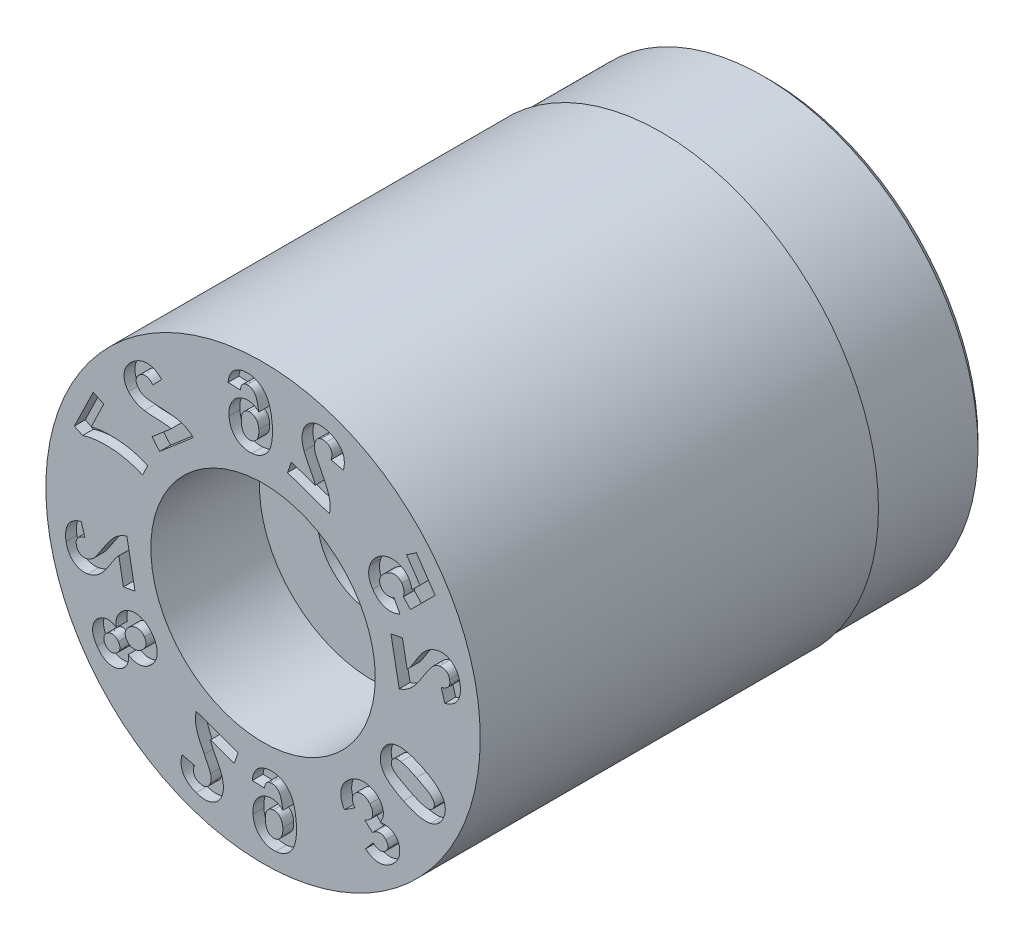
from build123d import *

# Parameters (mm, degrees)
SKETCH4_W          = 3
SKETCH4_H          = 1
CUT_EXTRUDE1_DEPTH = 0.3


with BuildPart() as part:
    # Sketch1 → Revolve1 (revolve)
    with BuildSketch(Plane(origin=(0, 0, 0), x_dir=(0, 0, -1), z_dir=(1, 0, 0)), mode=Mode.PRIVATE) as revolve1_sk:
        Polygon((0, 6), (0, 3.1), (3, 3.1), (3, 1.5), (14, 1.5), (14, 5.75), (13.75, 6), align=None)
    revolve(revolve1_sk.sketch.rotate(Axis((0, 0, 3.797909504), (0, 0, -1)), 90), axis=Axis((0, 0, 3.797909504), (0, 0, -1)))

    # Sketch4 → Cut-Revolve1 (revolve, cut)
    with BuildSketch(Plane(origin=(0, 0, 0), x_dir=(0, 0, -1), z_dir=(1, 0, 0)), mode=Mode.PRIVATE) as cut_revolve1_sk:
        with Locations((12.5, 6.435)):
            Rectangle(SKETCH4_W, SKETCH4_H)
    revolve(cut_revolve1_sk.sketch.rotate(Axis((0, 0, 0), (0, 0, -1)), 90), axis=Axis((0, 0, 0), (0, 0, -1)), mode=Mode.SUBTRACT)

    # Sketch5 → Cut-Extrude1 (cut)
    # profile 1 of 12: a face of its own
    with BuildSketch(Plane.XY):
        with BuildLine():
            Line((3.851545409, 1.325215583), (3.53271147, 1.264786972))
            Line((3.53271147, 1.264786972), (3.761229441, 0.062286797))
            add(Edge.make_bspline(
                [(3.761229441, 0.062286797), (3.790221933, 0.072159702), (3.848185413, 0.091898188), (3.930929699, 0.13313535), (4.009021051, 0.184055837), (4.07128676, 0.233844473), (4.119888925, 0.281100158), (4.159188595, 0.322999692), (4.200101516, 0.371919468), (4.243378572, 0.42716057), (4.289301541, 0.488597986), (4.336818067, 0.557197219), (4.386825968, 0.632065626), (4.420099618, 0.684726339), (4.437296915, 0.711943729)],
                knots=[0, 0, 0, 0, 1.147220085, 2.293589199, 3.454339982, 4.637223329, 5.275329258, 5.994362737, 6.789850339, 7.665130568, 8.624998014, 9.664856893, 10.793094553, 12, 12, 12, 12], degree=3))
            add(Edge.make_bspline(
                [(4.437296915, 0.711943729), (4.451053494, 0.733629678), (4.47726548, 0.774950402), (4.515248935, 0.833582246), (4.550087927, 0.885696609), (4.581806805, 0.931334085), (4.609434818, 0.97113946), (4.634828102, 1.003806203), (4.655883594, 1.030844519), (4.669968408, 1.045694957), (4.676173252, 1.052237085)],
                knots=[0, 0, 0, 0, 1.480685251, 2.821319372, 4.027849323, 5.09469801, 6.026007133, 6.820540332, 7.480407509, 8, 8, 8, 8], degree=3))
            add(Edge.make_bspline(
                [(4.676173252, 1.052237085), (4.691388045, 1.066417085), (4.720771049, 1.093801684), (4.770166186, 1.12535167), (4.819966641, 1.150257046), (4.855123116, 1.158579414), (4.872368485, 1.1626618)],
                knots=[0, 0, 0, 0, 1.090931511, 2.106820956, 3.071335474, 4, 4, 4, 4], degree=3))
            add(Edge.make_bspline(
                [(4.872368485, 1.1626618), (4.890603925, 1.165497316), (4.925280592, 1.170889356), (4.975835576, 1.168345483), (5.021358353, 1.156810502), (5.061405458, 1.135922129), (5.095348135, 1.106642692), (5.122681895, 1.069704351), (5.143190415, 1.02549051), (5.150676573, 0.992830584), (5.154580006, 0.975801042)],
                knots=[0, 0, 0, 0, 1.150072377, 2.186987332, 3.13691429, 4.061498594, 4.981295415, 5.911940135, 6.911243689, 8, 8, 8, 8], degree=3))
            add(Edge.make_bspline(
                [(5.154580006, 0.975801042), (5.157114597, 0.95863357), (5.161981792, 0.925666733), (5.158594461, 0.876845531), (5.145494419, 0.832149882), (5.127251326, 0.798288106), (5.107941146, 0.773726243), (5.090014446, 0.756506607), (5.069241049, 0.740441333), (5.045509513, 0.725560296), (5.018714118, 0.712129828), (4.989284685, 0.69917098), (4.956585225, 0.688099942), (4.933624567, 0.681887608), (4.921704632, 0.6786625)],
                knots=[0, 0, 0, 0, 1.462389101, 2.808237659, 4.094995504, 5.369015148, 6.02924103, 6.726811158, 7.462244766, 8.243668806, 9.088192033, 9.991417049, 10.957252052, 12, 12, 12, 12], degree=3))
            Line((4.921704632, 0.6786625), (5.02070932, 0.343313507))
            add(Edge.make_bspline(
                [(5.02070932, 0.343313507), (5.042968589, 0.350471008), (5.086183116, 0.364366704), (5.146914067, 0.390451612), (5.2022474, 0.419015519), (5.251736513, 0.451127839), (5.29558435, 0.486445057), (5.333330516, 0.525203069), (5.365491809, 0.566903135), (5.39138071, 0.611922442), (5.412378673, 0.659227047), (5.429262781, 0.708219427), (5.441434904, 0.759062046), (5.449951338, 0.811483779), (5.453393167, 0.865872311), (5.452837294, 0.921991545), (5.447388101, 0.979825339), (5.440966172, 1.018658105), (5.437697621, 1.038422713)],
                knots=[0, 0, 0, 0, 1.236899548, 2.40133801, 3.493579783, 4.529124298, 5.518326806, 6.467120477, 7.386052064, 8.298032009, 9.2085038, 10.121896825, 11.03658518, 11.9722747, 12.929255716, 13.917153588, 14.939899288, 16, 16, 16, 16], degree=3))
            add(Edge.make_bspline(
                [(5.437697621, 1.038422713), (5.433205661, 1.059842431), (5.42443768, 1.101652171), (5.406010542, 1.16146012), (5.383839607, 1.216842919), (5.358430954, 1.268173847), (5.328562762, 1.314839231), (5.29477013, 1.356936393), (5.257655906, 1.395141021), (5.216497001, 1.428149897), (5.17286481, 1.456389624), (5.128029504, 1.480219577), (5.081659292, 1.498247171), (5.034188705, 1.511513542), (4.985261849, 1.519914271), (4.935011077, 1.521935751), (4.883528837, 1.52011837), (4.849276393, 1.514406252), (4.831827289, 1.511496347)],
                knots=[0, 0, 0, 0, 1.215675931, 2.372911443, 3.472140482, 4.527892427, 5.550860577, 6.54423819, 7.523199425, 8.504681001, 9.468986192, 10.407992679, 11.321050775, 12.227730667, 13.14336324, 14.072288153, 15.01797241, 16, 16, 16, 16], degree=3))
            add(Edge.make_bspline(
                [(4.831827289, 1.511496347), (4.812054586, 1.507175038), (4.772679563, 1.498569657), (4.715742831, 1.47902357), (4.661025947, 1.454935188), (4.608710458, 1.425053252), (4.557808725, 1.389038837), (4.506925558, 1.347251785), (4.45603253, 1.298451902), (4.42359322, 1.262414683), (4.40678832, 1.243745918)],
                knots=[0, 0, 0, 0, 0.94710676, 1.88605221, 2.813236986, 3.743255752, 4.701947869, 5.729954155, 6.82402269, 8, 8, 8, 8], degree=3))
            add(Edge.make_bspline(
                [(4.40678832, 1.243745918), (4.400810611, 1.236702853), (4.388096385, 1.22172268), (4.36896055, 1.197023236), (4.348125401, 1.168959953), (4.325949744, 1.137137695), (4.301647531, 1.102019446), (4.276354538, 1.062916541), (4.249021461, 1.020650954), (4.22105945, 0.975935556), (4.19361328, 0.931656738), (4.167685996, 0.89045454), (4.144174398, 0.853625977), (4.123490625, 0.820791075), (4.104989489, 0.792433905), (4.088487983, 0.768708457), (4.075031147, 0.748874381), (4.053553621, 0.720697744), (4.02403901, 0.684553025), (3.994798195, 0.65689737), (3.980908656, 0.64376079)],
                knots=[0, 0, 0, 0, 0.676339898, 1.43853413, 2.287243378, 3.235403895, 4.278392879, 5.414137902, 6.645054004, 7.963955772, 9.275627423, 10.459589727, 11.528447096, 12.474941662, 13.301133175, 14.007271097, 14.591130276, 15.055552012, 16.601371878, 18, 18, 18, 18], degree=3))
            Line((3.980908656, 0.64376079), (3.851545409, 1.325215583))
        make_face()
    # profile 2 of 12: a face of its own
    with BuildSketch(Plane.XY):
        with BuildLine():
            Line((3.782445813, 1.863921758), (3.615967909, 2.171191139))
            add(Edge.make_bspline(
                [(3.615967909, 2.171191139), (3.59876559, 2.163174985), (3.565555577, 2.147699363), (3.513217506, 2.134888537), (3.461835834, 2.131135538), (3.412215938, 2.13737273), (3.36577415, 2.15113105), (3.324675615, 2.173727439), (3.287868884, 2.20230549), (3.269335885, 2.22708577), (3.259940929, 2.239647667)],
                knots=[0, 0, 0, 0, 1.143734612, 2.208041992, 3.233576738, 4.237713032, 5.212474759, 6.139180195, 7.056692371, 8, 8, 8, 8], degree=3))
            add(Edge.make_bspline(
                [(3.259940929, 2.239647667), (3.255114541, 2.247186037), (3.245645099, 2.261976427), (3.234483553, 2.285566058), (3.226499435, 2.309934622), (3.221252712, 2.335109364), (3.218753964, 2.361026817), (3.219172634, 2.387676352), (3.222927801, 2.414819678), (3.228915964, 2.442627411), (3.238282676, 2.470700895), (3.25162669, 2.498429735), (3.268855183, 2.525573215), (3.289446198, 2.552412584), (3.313302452, 2.579275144), (3.341646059, 2.604896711), (3.373075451, 2.630698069), (3.395860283, 2.646901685), (3.407613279, 2.655259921)],
                knots=[0, 0, 0, 0, 0.866916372, 1.700902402, 2.521173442, 3.346871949, 4.188305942, 5.039874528, 5.923638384, 6.839859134, 7.793690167, 8.784634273, 9.814591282, 10.903962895, 12.060757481, 13.29103438, 14.602646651, 16, 16, 16, 16], degree=3))
            add(Edge.make_bspline(
                [(3.407613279, 2.655259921), (3.418957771, 2.662656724), (3.4409779, 2.677014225), (3.474359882, 2.695649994), (3.506950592, 2.710686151), (3.538532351, 2.722796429), (3.569578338, 2.730762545), (3.599659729, 2.735871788), (3.628924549, 2.737096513), (3.657260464, 2.73523512), (3.684490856, 2.730010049), (3.710438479, 2.722103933), (3.735282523, 2.712264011), (3.758445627, 2.698933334), (3.780385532, 2.683334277), (3.800720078, 2.664734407), (3.819949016, 2.643849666), (3.831201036, 2.628185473), (3.836934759, 2.620203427)],
                knots=[0, 0, 0, 0, 1.333145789, 2.58769125, 3.759807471, 4.864837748, 5.912498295, 6.910370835, 7.863467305, 8.789306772, 9.700329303, 10.586354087, 11.457388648, 12.324719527, 13.21074431, 14.102694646, 15.03318482, 16, 16, 16, 16], degree=3))
            add(Edge.make_bspline(
                [(3.836934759, 2.620203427), (3.84362525, 2.609791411), (3.856899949, 2.58913278), (3.871854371, 2.55542548), (3.883197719, 2.520505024), (3.890461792, 2.483891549), (3.893677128, 2.445828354), (3.89270083, 2.406202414), (3.888287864, 2.365054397), (3.88204241, 2.337531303), (3.878839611, 2.323416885)],
                knots=[0, 0, 0, 0, 0.959411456, 1.903582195, 2.852365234, 3.804688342, 4.794152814, 5.810996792, 6.877433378, 8, 8, 8, 8], degree=3))
            Line((3.878839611, 2.323416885), (4.072068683, 2.112557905))
            Line((4.072068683, 2.112557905), (4.754160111, 2.793184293))
            Line((4.754160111, 2.793184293), (4.234821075, 3.555313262))
            Line((4.234821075, 3.555313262), (3.964694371, 3.371486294))
            Line((3.964694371, 3.371486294), (4.335106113, 2.828170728))
            Line((4.335106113, 2.828170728), (4.110864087, 2.608913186))
            add(Edge.make_bspline(
                [(4.110864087, 2.608913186), (4.10733236, 2.630018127), (4.100391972, 2.671492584), (4.081412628, 2.730930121), (4.057344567, 2.787229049), (4.03556637, 2.821324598), (4.024701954, 2.838333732)],
                knots=[0, 0, 0, 0, 1.037560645, 2.03896645, 3.021705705, 4, 4, 4, 4], degree=3))
            add(Edge.make_bspline(
                [(4.024701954, 2.838333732), (4.0135306, 2.853753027), (3.991584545, 2.884044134), (3.95405019, 2.925028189), (3.913594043, 2.961373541), (3.869483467, 2.992357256), (3.822808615, 3.0192864), (3.77258091, 3.04091368), (3.719208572, 3.057196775), (3.6634818, 3.069307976), (3.606372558, 3.076102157), (3.548880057, 3.076820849), (3.491777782, 3.071155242), (3.434728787, 3.06019146), (3.378028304, 3.042646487), (3.32165827, 3.019236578), (3.265140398, 2.990702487), (3.229231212, 2.967088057), (3.210862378, 2.955008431)],
                knots=[0, 0, 0, 0, 0.99342279, 1.9515728, 2.895292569, 3.82718809, 4.760649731, 5.70412967, 6.675289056, 7.669726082, 8.677928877, 9.672696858, 10.665270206, 11.668891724, 12.700732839, 13.757806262, 14.853037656, 16, 16, 16, 16], degree=3))
            add(Edge.make_bspline(
                [(3.210862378, 2.955008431), (3.195839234, 2.944299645), (3.166085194, 2.923090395), (3.124873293, 2.887615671), (3.087166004, 2.849620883), (3.053565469, 2.808736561), (3.022504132, 2.766014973), (2.995657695, 2.720339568), (2.972232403, 2.672179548), (2.959677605, 2.638630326), (2.953344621, 2.621707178)],
                knots=[0, 0, 0, 0, 1.032599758, 2.04511207, 3.040583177, 4.026091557, 5.005530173, 5.995160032, 6.988703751, 8, 8, 8, 8], degree=3))
            add(Edge.make_bspline(
                [(2.953344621, 2.621707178), (2.945978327, 2.598395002), (2.931541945, 2.552708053), (2.919342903, 2.48270143), (2.915921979, 2.413334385), (2.921781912, 2.344681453), (2.935791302, 2.276630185), (2.95915582, 2.209566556), (2.990588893, 2.14283931), (3.017594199, 2.100671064), (3.031415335, 2.079089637)],
                knots=[0, 0, 0, 0, 1.02766284, 2.014002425, 2.980033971, 3.941685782, 4.905100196, 5.895211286, 6.922783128, 8, 8, 8, 8], degree=3))
            add(Edge.make_bspline(
                [(3.031415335, 2.079089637), (3.043324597, 2.062415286), (3.066674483, 2.029722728), (3.10476101, 1.984487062), (3.145249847, 1.944500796), (3.187023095, 1.908648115), (3.231249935, 1.878454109), (3.276860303, 1.852303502), (3.32459309, 1.831275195), (3.374040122, 1.814951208), (3.424566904, 1.8039924), (3.475359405, 1.797355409), (3.526272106, 1.796295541), (3.577373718, 1.799644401), (3.628740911, 1.808052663), (3.680118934, 1.821950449), (3.731918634, 1.83988867), (3.765407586, 1.855817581), (3.782445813, 1.863921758)],
                knots=[0, 0, 0, 0, 1.140679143, 2.236471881, 3.287465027, 4.30642048, 5.297080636, 6.264557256, 7.230024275, 8.1961697, 9.158918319, 10.104673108, 11.04392301, 11.989529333, 12.952763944, 13.936573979, 14.950187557, 16, 16, 16, 16], degree=3))
        make_face()
    # profile 3 of 12: a face of its own
    with BuildSketch(Plane.XY):
        with BuildLine():
            Line((0.782873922, 3.998983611), (0.674993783, 3.692534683))
            Line((0.674993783, 3.692534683), (1.831429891, 3.285838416))
            add(Edge.make_bspline(
                [(1.831429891, 3.285838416), (1.837408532, 3.315958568), (1.849371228, 3.37622615), (1.855133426, 3.468545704), (1.85045397, 3.561753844), (1.838252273, 3.640527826), (1.822248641, 3.706574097), (1.805143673, 3.761512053), (1.783585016, 3.821703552), (1.757803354, 3.887118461), (1.726866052, 3.957549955), (1.69162751, 4.033222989), (1.652434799, 4.114481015), (1.623525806, 4.169724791), (1.608555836, 4.198331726)],
                knots=[0, 0, 0, 0, 1.1483174, 2.297674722, 3.450944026, 4.635651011, 5.274892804, 5.992962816, 6.787965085, 7.667459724, 8.623935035, 9.666562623, 10.791674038, 12, 12, 12, 12], degree=3))
            add(Edge.make_bspline(
                [(1.608555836, 4.198331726), (1.596709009, 4.221122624), (1.574084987, 4.264646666), (1.542621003, 4.327110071), (1.514727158, 4.383405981), (1.49075839, 4.433593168), (1.470799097, 4.47777702), (1.4549474, 4.515987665), (1.442795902, 4.548127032), (1.436651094, 4.567787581), (1.433926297, 4.576505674)],
                knots=[0, 0, 0, 0, 1.478213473, 2.82296139, 4.024992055, 5.093871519, 6.023590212, 6.814758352, 7.474427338, 8, 8, 8, 8], degree=3))
            add(Edge.make_bspline(
                [(1.433926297, 4.576505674), (1.429400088, 4.596873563), (1.420676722, 4.63612861), (1.417661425, 4.694660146), (1.421838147, 4.750184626), (1.432162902, 4.784800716), (1.437253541, 4.801868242)],
                knots=[0, 0, 0, 0, 1.093779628, 2.108042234, 3.067166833, 4, 4, 4, 4], degree=3))
            add(Edge.make_bspline(
                [(1.437253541, 4.801868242), (1.444035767, 4.818920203), (1.456988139, 4.851485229), (1.483915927, 4.894358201), (1.517291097, 4.92754996), (1.555285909, 4.951791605), (1.597535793, 4.967063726), (1.64327252, 4.971571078), (1.691781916, 4.967465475), (1.723766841, 4.957603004), (1.740474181, 4.952451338)],
                knots=[0, 0, 0, 0, 1.144902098, 2.186479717, 3.136505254, 4.061146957, 4.981191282, 5.914549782, 6.910664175, 8, 8, 8, 8], degree=3))
            add(Edge.make_bspline(
                [(1.740474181, 4.952451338), (1.756636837, 4.945931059), (1.787685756, 4.933405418), (1.828755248, 4.906390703), (1.860729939, 4.872258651), (1.881143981, 4.839541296), (1.892352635, 4.81040201), (1.898358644, 4.786341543), (1.902139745, 4.760281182), (1.902478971, 4.732106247), (1.901314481, 4.70210701), (1.89685783, 4.670172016), (1.890564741, 4.636120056), (1.884399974, 4.612949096), (1.881203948, 4.600936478)],
                knots=[0, 0, 0, 0, 1.464906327, 2.814126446, 4.098242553, 5.374086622, 6.032144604, 6.71883397, 7.457738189, 8.242955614, 9.086926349, 9.982600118, 10.954110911, 12, 12, 12, 12], degree=3))
            Line((1.881203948, 4.600936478), (2.221275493, 4.518550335))
            add(Edge.make_bspline(
                [(2.221275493, 4.518550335), (2.226109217, 4.541461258), (2.235485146, 4.585901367), (2.244199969, 4.651563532), (2.246819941, 4.713907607), (2.243921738, 4.772867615), (2.235149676, 4.828418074), (2.221107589, 4.880661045), (2.201272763, 4.929526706), (2.175400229, 4.974624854), (2.145239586, 5.016670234), (2.111036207, 5.055740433), (2.073393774, 5.092181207), (2.031681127, 5.12533842), (1.986341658, 5.155843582), (1.937428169, 5.18372209), (1.884616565, 5.208395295), (1.847662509, 5.222178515), (1.828834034, 5.229201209)],
                knots=[0, 0, 0, 0, 1.236974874, 2.399348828, 3.495245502, 4.529836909, 5.513281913, 6.461200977, 7.382445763, 8.291416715, 9.201893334, 10.112369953, 11.031622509, 11.966468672, 12.923965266, 13.916560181, 14.938465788, 16, 16, 16, 16], degree=3))
            add(Edge.make_bspline(
                [(1.828834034, 5.229201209), (1.808011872, 5.236022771), (1.767389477, 5.249331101), (1.70628547, 5.263614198), (1.647073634, 5.272415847), (1.589750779, 5.275549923), (1.534366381, 5.273660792), (1.480951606, 5.265472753), (1.429287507, 5.252239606), (1.380048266, 5.233322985), (1.333571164, 5.210074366), (1.290493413, 5.183102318), (1.25137426, 5.152001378), (1.216056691, 5.117296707), (1.184327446, 5.079047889), (1.157029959, 5.036858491), (1.133141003, 4.991241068), (1.120690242, 4.958800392), (1.114347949, 4.942275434)],
                knots=[0, 0, 0, 0, 1.215401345, 2.371152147, 3.477296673, 4.532957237, 5.552717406, 6.546554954, 7.525573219, 8.506583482, 9.467487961, 10.40538222, 11.321617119, 12.234904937, 13.148574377, 14.073217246, 15.018516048, 16, 16, 16, 16], degree=3))
            add(Edge.make_bspline(
                [(1.114347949, 4.942275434), (1.108089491, 4.922847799), (1.095727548, 4.884473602), (1.083934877, 4.825212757), (1.07763429, 4.765705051), (1.077300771, 4.705151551), (1.082361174, 4.642888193), (1.093610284, 4.577794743), (1.11000958, 4.509323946), (1.124923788, 4.463247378), (1.13260805, 4.439507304)],
                knots=[0, 0, 0, 0, 0.953708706, 1.883801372, 2.819219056, 3.747837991, 4.710998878, 5.736251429, 6.833646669, 8, 8, 8, 8], degree=3))
            add(Edge.make_bspline(
                [(1.13260805, 4.439507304), (1.135706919, 4.430836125), (1.142323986, 4.412320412), (1.153908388, 4.383096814), (1.16858147, 4.351115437), (1.184257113, 4.315381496), (1.203221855, 4.277111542), (1.223767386, 4.235327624), (1.246882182, 4.190563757), (1.271553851, 4.143803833), (1.295883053, 4.097595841), (1.319203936, 4.054843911), (1.338556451, 4.015683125), (1.356675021, 3.981284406), (1.371455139, 3.950751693), (1.38483197, 3.924981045), (1.394257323, 3.902878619), (1.408858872, 3.8705589), (1.424644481, 3.826493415), (1.433547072, 3.787205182), (1.437790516, 3.768478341)],
                knots=[0, 0, 0, 0, 0.672864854, 1.436779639, 2.296084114, 3.243669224, 4.28777445, 5.416459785, 6.646172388, 7.968885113, 9.279784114, 10.462179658, 11.526924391, 12.471314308, 13.302778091, 14.005698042, 14.591949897, 15.057764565, 16.597575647, 18, 18, 18, 18], degree=3))
            Line((1.437790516, 3.768478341), (0.782873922, 3.998983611))
        make_face()
    # profile 4 of 12: a face of its own
    with BuildSketch(Plane.XY):
        with BuildLine():
            Line((-0.966118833, 5.029682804), (-0.624882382, 5.017687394))
            add(Edge.make_bspline(
                [(-0.624882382, 5.017687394), (-0.623544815, 5.034276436), (-0.621023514, 5.065546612), (-0.610859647, 5.109205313), (-0.594571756, 5.146376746), (-0.572552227, 5.17699731), (-0.545801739, 5.201664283), (-0.514271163, 5.219804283), (-0.478459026, 5.232056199), (-0.452915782, 5.234855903), (-0.439692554, 5.236305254)],
                knots=[0, 0, 0, 0, 1.250947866, 2.358023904, 3.355452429, 4.283624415, 5.175751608, 6.07170113, 7.001758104, 8, 8, 8, 8], degree=3))
            add(Edge.make_bspline(
                [(-0.439692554, 5.236305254), (-0.430639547, 5.236584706), (-0.412735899, 5.237137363), (-0.386130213, 5.23483482), (-0.360310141, 5.228815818), (-0.335538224, 5.219323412), (-0.311339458, 5.207097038), (-0.288185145, 5.191447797), (-0.26601652, 5.172444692), (-0.24392583, 5.150501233), (-0.223177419, 5.122993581), (-0.204123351, 5.088977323), (-0.186927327, 5.047947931), (-0.170086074, 5.000471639), (-0.155308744, 4.945981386), (-0.141437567, 4.884764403), (-0.128808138, 4.816778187), (-0.121806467, 4.768983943), (-0.118155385, 4.744061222)],
                knots=[0, 0, 0, 0, 0.667054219, 1.319197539, 1.961399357, 2.613856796, 3.269509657, 3.955224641, 4.667210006, 5.418678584, 6.2452494, 7.196824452, 8.283847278, 9.519598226, 10.906390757, 12.4408983, 14.144075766, 16, 16, 16, 16], degree=3))
            add(Edge.make_bspline(
                [(-0.118155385, 4.744061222), (-0.130031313, 4.755561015), (-0.153274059, 4.778067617), (-0.191386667, 4.806989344), (-0.23129228, 4.83055787), (-0.272496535, 4.849804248), (-0.315762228, 4.863057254), (-0.360301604, 4.872384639), (-0.40682873, 4.875937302), (-0.43816512, 4.874547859), (-0.454129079, 4.873840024)],
                knots=[0, 0, 0, 0, 1.064154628, 2.082690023, 3.072725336, 4.045143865, 5.004333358, 5.980672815, 6.971277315, 8, 8, 8, 8], degree=3))
            add(Edge.make_bspline(
                [(-0.454129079, 4.873840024), (-0.472006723, 4.872096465), (-0.507317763, 4.868652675), (-0.5587245, 4.856547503), (-0.608033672, 4.840082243), (-0.654924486, 4.818150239), (-0.699175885, 4.790926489), (-0.740903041, 4.758625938), (-0.780727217, 4.721849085), (-0.817377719, 4.679890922), (-0.850740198, 4.634423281), (-0.878998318, 4.585509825), (-0.90263155, 4.534124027), (-0.920557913, 4.47988789), (-0.933500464, 4.423047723), (-0.941458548, 4.363523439), (-0.944123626, 4.301241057), (-0.942084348, 4.258984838), (-0.94104667, 4.23748294)],
                knots=[0, 0, 0, 0, 0.963140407, 1.902347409, 2.827183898, 3.749359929, 4.674125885, 5.609900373, 6.577500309, 7.578890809, 8.595452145, 9.599574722, 10.6055794, 11.625983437, 12.659535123, 13.73020296, 14.845023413, 16, 16, 16, 16], degree=3))
            add(Edge.make_bspline(
                [(-0.94104667, 4.23748294), (-0.938939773, 4.214699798), (-0.934827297, 4.170229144), (-0.922154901, 4.105748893), (-0.90465461, 4.045260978), (-0.882547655, 3.98843541), (-0.855168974, 3.935628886), (-0.823226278, 3.886331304), (-0.786231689, 3.840874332), (-0.744303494, 3.800094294), (-0.699253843, 3.763353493), (-0.650741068, 3.732655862), (-0.600210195, 3.706382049), (-0.546604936, 3.686990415), (-0.490829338, 3.672349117), (-0.432480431, 3.662920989), (-0.371503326, 3.659791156), (-0.330189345, 3.661723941), (-0.309173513, 3.662707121)],
                knots=[0, 0, 0, 0, 1.142596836, 2.230246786, 3.277241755, 4.285345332, 5.271511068, 6.243900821, 7.21561216, 8.19289187, 9.161651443, 10.114487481, 11.056444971, 12.001497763, 12.955855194, 13.93434876, 14.949232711, 16, 16, 16, 16], degree=3))
            add(Edge.make_bspline(
                [(-0.309173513, 3.662707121), (-0.286665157, 3.66506039), (-0.242564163, 3.669671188), (-0.178545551, 3.684626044), (-0.117899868, 3.705643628), (-0.061254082, 3.734297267), (-0.007525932, 3.768115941), (0.041800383, 3.809622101), (0.087677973, 3.857257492), (0.130515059, 3.911078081), (0.168350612, 3.972495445), (0.199359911, 4.042412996), (0.224274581, 4.120223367), (0.242568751, 4.206180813), (0.255020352, 4.300116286), (0.261135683, 4.402167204), (0.261758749, 4.512336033), (0.257043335, 4.588250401), (0.254601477, 4.62756235)],
                knots=[0, 0, 0, 0, 0.859978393, 1.684969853, 2.494155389, 3.295055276, 4.094017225, 4.903405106, 5.739869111, 6.605944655, 7.51473212, 8.475194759, 9.50751068, 10.616623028, 11.813023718, 13.108000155, 14.502389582, 16, 16, 16, 16], degree=3))
            add(Edge.make_bspline(
                [(0.254601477, 4.62756235), (0.251062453, 4.667886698), (0.244235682, 4.745672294), (0.227141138, 4.857466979), (0.205844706, 4.960322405), (0.178030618, 5.053672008), (0.146209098, 5.13827793), (0.108634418, 5.213525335), (0.066110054, 5.279991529), (0.017868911, 5.336903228), (-0.034492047, 5.385292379), (-0.089576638, 5.426799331), (-0.147959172, 5.460667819), (-0.208856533, 5.488510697), (-0.273387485, 5.50732486), (-0.340355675, 5.519912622), (-0.410396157, 5.525528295), (-0.457830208, 5.523295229), (-0.482083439, 5.522153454)],
                knots=[0, 0, 0, 0, 1.48040829, 2.855704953, 4.134678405, 5.319447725, 6.415318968, 7.437211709, 8.390545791, 9.294771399, 10.158119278, 10.993946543, 11.81237346, 12.622776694, 13.437059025, 14.264274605, 15.112516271, 16, 16, 16, 16], degree=3))
            add(Edge.make_bspline(
                [(-0.482083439, 5.522153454), (-0.498979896, 5.520536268), (-0.532161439, 5.517360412), (-0.580400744, 5.50821999), (-0.626346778, 5.495943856), (-0.669631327, 5.479904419), (-0.710410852, 5.460193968), (-0.748918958, 5.437565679), (-0.784557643, 5.41070388), (-0.817887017, 5.380954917), (-0.847955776, 5.347578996), (-0.875296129, 5.311453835), (-0.898837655, 5.271979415), (-0.919253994, 5.22943637), (-0.936091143, 5.183813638), (-0.949904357, 5.135215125), (-0.960247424, 5.083597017), (-0.964130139, 5.047943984), (-0.966118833, 5.029682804)],
                knots=[0, 0, 0, 0, 1.07040148, 2.102072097, 3.093348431, 4.067844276, 5.009317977, 5.947851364, 6.880766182, 7.820259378, 8.762147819, 9.710393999, 10.674101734, 11.656610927, 12.683553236, 13.738205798, 14.841528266, 16, 16, 16, 16], degree=3))
        make_face()
        with BuildLine():
            add(Edge.make_bspline(
                [(-0.117283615, 4.326109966), (-0.116583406, 4.312286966), (-0.115221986, 4.285410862), (-0.115552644, 4.246068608), (-0.118995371, 4.209064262), (-0.125091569, 4.174272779), (-0.133639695, 4.141685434), (-0.144563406, 4.111092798), (-0.159084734, 4.083217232), (-0.175115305, 4.057326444), (-0.193346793, 4.034211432), (-0.212675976, 4.013802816), (-0.232902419, 3.996004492), (-0.254183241, 3.981398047), (-0.276186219, 3.969276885), (-0.299160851, 3.960352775), (-0.323122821, 3.953990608), (-0.33955965, 3.952229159), (-0.347878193, 3.951337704)],
                knots=[0, 0, 0, 0, 1.356719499, 2.637874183, 3.853129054, 4.995783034, 6.096533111, 7.152964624, 8.172284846, 9.171698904, 10.13444092, 11.052444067, 11.924495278, 12.770196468, 13.577995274, 14.381472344, 15.180876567, 16, 16, 16, 16], degree=3))
            add(Edge.make_bspline(
                [(-0.347878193, 3.951337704), (-0.363655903, 3.950981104), (-0.394416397, 3.950285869), (-0.439220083, 3.962185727), (-0.480358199, 3.983435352), (-0.510881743, 4.009259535), (-0.532701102, 4.034683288), (-0.547666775, 4.057376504), (-0.560834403, 4.083295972), (-0.571998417, 4.112379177), (-0.581637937, 4.144576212), (-0.589469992, 4.179901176), (-0.594970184, 4.218531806), (-0.597524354, 4.245331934), (-0.598842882, 4.259166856)],
                knots=[0, 0, 0, 0, 1.262911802, 2.462194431, 3.678869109, 4.958841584, 5.646467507, 6.366438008, 7.137664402, 7.978382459, 8.866469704, 9.836560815, 10.883176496, 12, 12, 12, 12], degree=3))
            add(Edge.make_bspline(
                [(-0.598842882, 4.259166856), (-0.599634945, 4.273476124), (-0.601169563, 4.30120026), (-0.600785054, 4.341569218), (-0.598275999, 4.379180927), (-0.593529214, 4.41400043), (-0.585955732, 4.445981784), (-0.575691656, 4.474970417), (-0.563616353, 4.501509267), (-0.548699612, 4.524811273), (-0.532273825, 4.54566229), (-0.514544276, 4.564137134), (-0.495058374, 4.579650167), (-0.474557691, 4.592855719), (-0.452795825, 4.603656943), (-0.429745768, 4.611809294), (-0.405405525, 4.617910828), (-0.388586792, 4.61947397), (-0.38000835, 4.620271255)],
                knots=[0, 0, 0, 0, 1.445529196, 2.800705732, 4.069879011, 5.246454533, 6.342090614, 7.378934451, 8.34497378, 9.27668567, 10.162321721, 11.020109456, 11.853457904, 12.669009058, 13.476513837, 14.298164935, 15.131974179, 16, 16, 16, 16], degree=3))
            add(Edge.make_bspline(
                [(-0.38000835, 4.620271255), (-0.37171799, 4.620724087), (-0.355470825, 4.621611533), (-0.331355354, 4.619202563), (-0.307972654, 4.615148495), (-0.285529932, 4.607744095), (-0.263759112, 4.598316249), (-0.242972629, 4.585945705), (-0.222747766, 4.571319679), (-0.203486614, 4.554146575), (-0.185726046, 4.534412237), (-0.169472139, 4.512367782), (-0.155914, 4.487349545), (-0.144037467, 4.459930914), (-0.133995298, 4.430140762), (-0.126413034, 4.397727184), (-0.120336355, 4.362892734), (-0.118321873, 4.338620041), (-0.117283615, 4.326109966)],
                knots=[0, 0, 0, 0, 0.897474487, 1.75884004, 2.616913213, 3.461583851, 4.310328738, 5.180684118, 6.074207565, 7.009141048, 7.968265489, 8.943939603, 9.966707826, 11.041101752, 12.176031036, 13.364562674, 14.641703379, 16, 16, 16, 16], degree=3))
        make_face(mode=Mode.SUBTRACT)
    # profile 5 of 12: a face of its own
    with BuildSketch(Plane.XY):
        with BuildLine():
            Line((-3.067709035, 2.678975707), (-2.856150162, 2.432695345))
            Line((-2.856150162, 2.432695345), (-1.926551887, 3.230796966))
            add(Edge.make_bspline(
                [(-1.926551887, 3.230796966), (-1.949504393, 3.251183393), (-1.995339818, 3.291894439), (-2.073050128, 3.34211512), (-2.155613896, 3.385463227), (-2.230151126, 3.414217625), (-2.295300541, 3.432967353), (-2.351287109, 3.446041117), (-2.414137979, 3.457292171), (-2.483682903, 3.467674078), (-2.560080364, 3.476324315), (-2.643158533, 3.483357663), (-2.732996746, 3.48938), (-2.795137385, 3.49225072), (-2.827342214, 3.493738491)],
                knots=[0, 0, 0, 0, 1.14849432, 2.293506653, 3.454958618, 4.637592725, 5.278116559, 5.993637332, 6.790200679, 7.669288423, 8.627314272, 9.669765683, 10.792339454, 12, 12, 12, 12], degree=3))
            add(Edge.make_bspline(
                [(-2.827342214, 3.493738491), (-2.853035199, 3.494734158), (-2.902037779, 3.49663313), (-2.971913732, 3.500932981), (-3.034691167, 3.504805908), (-3.09020278, 3.509252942), (-3.138466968, 3.51394926), (-3.179451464, 3.519112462), (-3.213381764, 3.524352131), (-3.233377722, 3.529074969), (-3.24224916, 3.531170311)],
                knots=[0, 0, 0, 0, 1.479466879, 2.821692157, 4.02821588, 5.09857411, 6.026030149, 6.818124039, 7.475647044, 8, 8, 8, 8], degree=3))
            add(Edge.make_bspline(
                [(-3.24224916, 3.531170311), (-3.262080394, 3.537334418), (-3.300462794, 3.549264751), (-3.352559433, 3.576215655), (-3.39895913, 3.607312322), (-3.423718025, 3.633763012), (-3.435897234, 3.646774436)],
                knots=[0, 0, 0, 0, 1.087477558, 2.104760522, 3.067708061, 4, 4, 4, 4], degree=3))
            add(Edge.make_bspline(
                [(-3.435897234, 3.646774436), (-3.447517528, 3.66112835), (-3.469590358, 3.688393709), (-3.492138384, 3.733810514), (-3.505130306, 3.778995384), (-3.506817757, 3.824131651), (-3.49858097, 3.868147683), (-3.479959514, 3.910011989), (-3.452103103, 3.950106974), (-3.427400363, 3.972789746), (-3.414424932, 3.984704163)],
                knots=[0, 0, 0, 0, 1.149650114, 2.183768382, 3.141504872, 4.063448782, 4.976547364, 5.912168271, 6.903339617, 8, 8, 8, 8], degree=3))
            add(Edge.make_bspline(
                [(-3.414424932, 3.984704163), (-3.400778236, 3.995368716), (-3.374514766, 4.015892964), (-3.330662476, 4.037461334), (-3.285290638, 4.04838657), (-3.246710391, 4.049645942), (-3.215750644, 4.044812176), (-3.191843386, 4.03811972), (-3.16770818, 4.027898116), (-3.143052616, 4.014488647), (-3.117623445, 3.998520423), (-3.092314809, 3.978513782), (-3.066245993, 3.955901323), (-3.049297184, 3.939144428), (-3.040519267, 3.930465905)],
                knots=[0, 0, 0, 0, 1.458685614, 2.807283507, 4.085520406, 5.370590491, 6.034025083, 6.723199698, 7.459854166, 8.240144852, 9.089538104, 9.98966515, 10.958832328, 12, 12, 12, 12], degree=3))
            Line((-3.040519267, 3.930465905), (-2.798574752, 4.184088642))
            add(Edge.make_bspline(
                [(-2.798574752, 4.184088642), (-2.816003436, 4.199738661), (-2.849758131, 4.230048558), (-2.902500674, 4.270111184), (-2.955017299, 4.30370502), (-3.007487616, 4.330798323), (-3.059939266, 4.350872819), (-3.112200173, 4.364813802), (-3.164511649, 4.371700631), (-3.216468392, 4.372137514), (-3.267926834, 4.366769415), (-3.3188506, 4.356570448), (-3.369303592, 4.34195762), (-3.419040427, 4.322612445), (-3.467997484, 4.298704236), (-3.516113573, 4.269995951), (-3.564026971, 4.237079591), (-3.594460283, 4.211922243), (-3.61001639, 4.199062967)],
                knots=[0, 0, 0, 0, 1.237893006, 2.397467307, 3.496814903, 4.52993103, 5.513406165, 6.460209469, 7.3827077, 8.294812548, 9.200628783, 10.112895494, 11.036947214, 11.973874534, 12.930584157, 13.913565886, 14.933511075, 16, 16, 16, 16], degree=3))
            add(Edge.make_bspline(
                [(-3.61001639, 4.199062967), (-3.626312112, 4.184490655), (-3.65815884, 4.156011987), (-3.701170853, 4.110425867), (-3.737895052, 4.063226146), (-3.769468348, 4.015453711), (-3.79506974, 3.966273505), (-3.81537952, 3.916107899), (-3.829160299, 3.864510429), (-3.837478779, 3.812455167), (-3.840842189, 3.760699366), (-3.838290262, 3.709925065), (-3.83146961, 3.660570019), (-3.819520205, 3.612547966), (-3.801589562, 3.566246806), (-3.779049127, 3.521419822), (-3.751531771, 3.477800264), (-3.729628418, 3.450842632), (-3.71843948, 3.437071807)],
                knots=[0, 0, 0, 0, 1.21343022, 2.371406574, 3.473925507, 4.530208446, 5.54625255, 6.547371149, 7.528939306, 8.504444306, 9.4703618, 10.402820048, 11.322135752, 12.233086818, 13.143501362, 14.072885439, 15.01556788, 16, 16, 16, 16], degree=3))
            add(Edge.make_bspline(
                [(-3.71843948, 3.437071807), (-3.704843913, 3.421977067), (-3.677851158, 3.392007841), (-3.632588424, 3.352180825), (-3.583854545, 3.317371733), (-3.53173628, 3.2868611), (-3.475323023, 3.259875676), (-3.413391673, 3.237490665), (-3.346114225, 3.216978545), (-3.298795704, 3.207079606), (-3.274312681, 3.201957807)],
                knots=[0, 0, 0, 0, 0.950347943, 1.886828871, 2.815364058, 3.749864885, 4.71059794, 5.738159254, 6.829703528, 8, 8, 8, 8], degree=3))
            add(Edge.make_bspline(
                [(-3.274312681, 3.201957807), (-3.265254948, 3.200239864), (-3.245934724, 3.196575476), (-3.214748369, 3.192288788), (-3.179781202, 3.188509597), (-3.140943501, 3.184703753), (-3.098290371, 3.181519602), (-3.051716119, 3.17897053), (-3.0013781, 3.176291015), (-2.948733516, 3.174534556), (-2.896567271, 3.172750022), (-2.847886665, 3.1707297), (-2.804170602, 3.169073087), (-2.765469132, 3.166585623), (-2.731696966, 3.165009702), (-2.702815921, 3.162707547), (-2.678900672, 3.160596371), (-2.643713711, 3.156605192), (-2.597848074, 3.148314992), (-2.559463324, 3.136699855), (-2.541206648, 3.131175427)],
                knots=[0, 0, 0, 0, 0.674219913, 1.438117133, 2.301560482, 3.246672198, 4.292227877, 5.429638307, 6.658247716, 7.97912687, 9.282155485, 10.475995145, 11.542806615, 12.481703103, 13.312398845, 14.015409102, 14.600630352, 15.068268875, 16.605600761, 18, 18, 18, 18], degree=3))
            Line((-2.541206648, 3.131175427), (-3.067709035, 2.678975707))
        make_face()
    # profile 6 of 12: a face of its own
    with BuildSketch(Plane.XY):
        with BuildLine():
            Line((-4.400658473, 2.792051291), (-4.691959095, 2.933377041))
            Line((-4.691959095, 2.933377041), (-5.212138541, 1.860258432))
            Line((-5.212138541, 1.860258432), (-4.98439017, 1.749967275))
            add(Edge.make_bspline(
                [(-4.98439017, 1.749967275), (-4.967525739, 1.755681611), (-4.932979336, 1.767387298), (-4.878626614, 1.782219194), (-4.820861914, 1.795576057), (-4.759339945, 1.807331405), (-4.694236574, 1.817418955), (-4.625429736, 1.826289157), (-4.552993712, 1.83309453), (-4.451748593, 1.840770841), (-4.322571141, 1.843939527), (-4.166760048, 1.839041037), (-4.01119857, 1.822935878), (-3.882550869, 1.801739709), (-3.781327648, 1.780625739), (-3.708229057, 1.762699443), (-3.637879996, 1.744218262), (-3.570660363, 1.724029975), (-3.506329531, 1.702336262), (-3.44497077, 1.679222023), (-3.3864206, 1.654891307), (-3.348919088, 1.637229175), (-3.330474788, 1.628542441)],
                knots=[0, 0, 0, 0, 0.630685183, 1.291944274, 1.994811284, 2.730689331, 3.510270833, 4.32838924, 5.188005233, 6.087384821, 7.925034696, 9.762478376, 11.606241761, 13.461033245, 14.378886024, 15.268736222, 16.127061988, 16.955386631, 17.754599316, 18.531661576, 19.2778298, 20, 20, 20, 20], degree=3))
            Line((-3.330474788, 1.628542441), (-3.183906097, 1.931039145))
            add(Edge.make_bspline(
                [(-3.183906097, 1.931039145), (-3.212760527, 1.943829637), (-3.270748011, 1.969534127), (-3.360414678, 2.00257736), (-3.451996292, 2.03305803), (-3.546065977, 2.058924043), (-3.642246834, 2.081953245), (-3.740854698, 2.100630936), (-3.841753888, 2.115823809), (-3.944405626, 2.127264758), (-4.04767367, 2.134841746), (-4.150506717, 2.138745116), (-4.252361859, 2.138777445), (-4.353183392, 2.133769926), (-4.453092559, 2.126797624), (-4.551952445, 2.114694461), (-4.64986439, 2.099069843), (-4.714407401, 2.085382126), (-4.746609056, 2.078553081)],
                knots=[0, 0, 0, 0, 0.949114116, 1.907393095, 2.872913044, 3.851582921, 4.840829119, 5.846939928, 6.869243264, 7.909287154, 8.952876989, 9.983032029, 11.004032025, 12.015314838, 13.018768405, 14.015749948, 15.010022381, 16, 16, 16, 16], degree=3))
            Line((-4.746609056, 2.078553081), (-4.400658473, 2.792051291))
        make_face()
    # profile 7 of 12: a face of its own
    with BuildSketch(Plane.XY):
        with BuildLine():
            Line((-3.857130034, -1.309150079), (-3.538350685, -1.249901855))
            Line((-3.538350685, -1.249901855), (-3.761354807, -0.04719488))
            add(Edge.make_bspline(
                [(-3.761354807, -0.04719488), (-3.790389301, -0.056943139), (-3.848449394, -0.07643667), (-3.931175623, -0.117411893), (-4.00973558, -0.167496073), (-4.071909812, -0.217244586), (-4.121097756, -0.263868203), (-4.160048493, -0.306018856), (-4.201620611, -0.35437055), (-4.244989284, -0.40958455), (-4.291003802, -0.470936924), (-4.338464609, -0.539362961), (-4.388979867, -0.61381361), (-4.422471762, -0.666303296), (-4.439828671, -0.693505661)],
                knots=[0, 0, 0, 0, 1.147734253, 2.295116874, 3.451974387, 4.636882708, 5.275331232, 5.992592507, 6.788507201, 7.666594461, 8.625516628, 9.664667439, 10.789732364, 12, 12, 12, 12], degree=3))
            add(Edge.make_bspline(
                [(-4.439828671, -0.693505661), (-4.453551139, -0.715182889), (-4.479710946, -0.756507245), (-4.518420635, -0.81471612), (-4.55329004, -0.866770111), (-4.58516364, -0.912262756), (-4.613092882, -0.951732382), (-4.638738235, -0.98420092), (-4.66001147, -1.011068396), (-4.674214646, -1.025805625), (-4.680471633, -1.032297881)],
                knots=[0, 0, 0, 0, 1.479778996, 2.820974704, 4.032060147, 5.093480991, 6.025180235, 6.820046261, 7.480189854, 8, 8, 8, 8], degree=3))
            add(Edge.make_bspline(
                [(-4.680471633, -1.032297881), (-4.695763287, -1.046448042), (-4.725196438, -1.073684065), (-4.774448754, -1.105393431), (-4.824468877, -1.129589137), (-4.859585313, -1.137948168), (-4.876804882, -1.142047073)],
                knots=[0, 0, 0, 0, 1.094067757, 2.105845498, 3.071189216, 4, 4, 4, 4], degree=3))
            add(Edge.make_bspline(
                [(-4.876804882, -1.142047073), (-4.895062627, -1.144702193), (-4.929731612, -1.149743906), (-4.980310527, -1.14724535), (-5.025894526, -1.135576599), (-5.065688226, -1.114266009), (-5.099549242, -1.085044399), (-5.126325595, -1.047833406), (-5.147070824, -1.003733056), (-5.154211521, -0.970965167), (-5.157933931, -0.953883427)],
                knots=[0, 0, 0, 0, 1.150536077, 2.184712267, 3.141232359, 4.066189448, 4.979577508, 5.910597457, 6.910804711, 8, 8, 8, 8], degree=3))
            add(Edge.make_bspline(
                [(-5.157933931, -0.953883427), (-5.160307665, -0.936694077), (-5.164858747, -0.903737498), (-5.161407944, -0.855004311), (-5.148677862, -0.810200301), (-5.129986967, -0.776518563), (-5.11049775, -0.752113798), (-5.092448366, -0.735008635), (-5.071448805, -0.71922389), (-5.04801139, -0.704062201), (-5.021127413, -0.690995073), (-4.991734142, -0.678267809), (-4.958922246, -0.667578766), (-4.936005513, -0.66126229), (-4.924113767, -0.657984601)],
                knots=[0, 0, 0, 0, 1.463832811, 2.806558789, 4.096511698, 5.371789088, 6.032666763, 6.730925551, 7.467085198, 8.25127775, 9.086299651, 9.990416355, 10.957204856, 12, 12, 12, 12], degree=3))
            Line((-4.924113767, -0.657984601), (-5.021460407, -0.322249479))
            add(Edge.make_bspline(
                [(-5.021460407, -0.322249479), (-5.043734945, -0.329342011), (-5.08698764, -0.343114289), (-5.1477895, -0.369062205), (-5.203232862, -0.397513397), (-5.252671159, -0.42955237), (-5.296674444, -0.464508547), (-5.334663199, -0.502868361), (-5.367132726, -0.544322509), (-5.393420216, -0.589015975), (-5.414434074, -0.636143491), (-5.431376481, -0.685034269), (-5.443891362, -0.735868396), (-5.452206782, -0.788422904), (-5.455733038, -0.842783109), (-5.45569633, -0.898846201), (-5.450801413, -0.956712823), (-5.44440251, -0.995525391), (-5.441147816, -1.015266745)],
                knots=[0, 0, 0, 0, 1.237350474, 2.402687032, 3.496300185, 4.533792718, 5.517388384, 6.466751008, 7.386233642, 8.298760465, 9.205142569, 10.114881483, 11.035445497, 11.974044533, 12.92883213, 13.917322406, 14.940681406, 16, 16, 16, 16], degree=3))
            add(Edge.make_bspline(
                [(-5.441147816, -1.015266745), (-5.436670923, -1.036667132), (-5.427928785, -1.078456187), (-5.410224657, -1.138464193), (-5.388020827, -1.193865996), (-5.362700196, -1.245107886), (-5.333239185, -1.291884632), (-5.299921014, -1.334280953), (-5.262800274, -1.372416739), (-5.221834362, -1.405522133), (-5.178667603, -1.434303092), (-5.133603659, -1.457666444), (-5.087429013, -1.47635807), (-5.039922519, -1.48974728), (-4.990975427, -1.498081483), (-4.940853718, -1.50076875), (-4.88941764, -1.498738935), (-4.855157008, -1.493393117), (-4.837683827, -1.490666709)],
                knots=[0, 0, 0, 0, 1.215505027, 2.373546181, 3.473604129, 4.530731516, 5.547709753, 6.541778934, 7.524110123, 8.500340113, 9.465316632, 10.404330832, 11.318024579, 12.230798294, 13.14357201, 14.07314362, 15.017288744, 16, 16, 16, 16], degree=3))
            add(Edge.make_bspline(
                [(-4.837683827, -1.490666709), (-4.817867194, -1.486535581), (-4.778410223, -1.478310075), (-4.721581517, -1.458794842), (-4.666901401, -1.434880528), (-4.614704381, -1.405013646), (-4.563337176, -1.369578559), (-4.512416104, -1.32785071), (-4.461643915, -1.27914322), (-4.429068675, -1.24347199), (-4.412206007, -1.225006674)],
                knots=[0, 0, 0, 0, 0.948460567, 1.888483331, 2.811506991, 3.7436924, 4.703754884, 5.735018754, 6.827525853, 8, 8, 8, 8], degree=3))
            add(Edge.make_bspline(
                [(-4.412206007, -1.225006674), (-4.406301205, -1.218043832), (-4.393663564, -1.20314174), (-4.374195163, -1.178625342), (-4.353252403, -1.150431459), (-4.330511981, -1.118838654), (-4.306709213, -1.083416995), (-4.280894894, -1.044819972), (-4.25352943, -1.002603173), (-4.22554026, -0.958053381), (-4.197815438, -0.913892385), (-4.171954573, -0.872676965), (-4.148010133, -0.836040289), (-4.127121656, -0.803332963), (-4.108329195, -0.775293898), (-4.092042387, -0.751542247), (-4.07825291, -0.731989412), (-4.057192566, -0.703422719), (-4.027073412, -0.667859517), (-3.997680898, -0.640619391), (-3.983781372, -0.627737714)],
                knots=[0, 0, 0, 0, 0.669052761, 1.431927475, 2.293807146, 3.242814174, 4.284401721, 5.42116073, 6.645882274, 7.971324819, 9.276952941, 10.467331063, 11.537142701, 12.484482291, 13.311411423, 14.010741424, 14.595121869, 15.064730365, 16.611930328, 18, 18, 18, 18], degree=3))
            Line((-3.983781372, -0.627737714), (-3.857130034, -1.309150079))
        make_face()
    # profile 8 of 12: a face of its own
    with BuildSketch(Plane.XY):
        with BuildLine():
            add(Edge.make_bspline(
                [(-4.049796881, -2.377174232), (-4.059939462, -2.370836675), (-4.079726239, -2.358472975), (-4.110063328, -2.342206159), (-4.140276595, -2.328815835), (-4.170456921, -2.318344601), (-4.200290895, -2.310309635), (-4.229960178, -2.304655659), (-4.259596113, -2.301890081), (-4.298553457, -2.302242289), (-4.34639927, -2.307390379), (-4.401873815, -2.32179343), (-4.455356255, -2.343286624), (-4.488031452, -2.363707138), (-4.504543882, -2.374026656)],
                knots=[0, 0, 0, 0, 0.888200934, 1.732757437, 2.554572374, 3.340274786, 4.10322799, 4.847783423, 5.581180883, 6.309907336, 7.738967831, 9.14265463, 10.556038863, 12, 12, 12, 12], degree=3))
            add(Edge.make_bspline(
                [(-4.504543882, -2.374026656), (-4.5181313, -2.383600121), (-4.544802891, -2.402392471), (-4.580287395, -2.434970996), (-4.612041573, -2.469271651), (-4.638729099, -2.50663062), (-4.662027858, -2.545915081), (-4.680331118, -2.588137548), (-4.694705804, -2.632566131), (-4.70422822, -2.679214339), (-4.708903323, -2.727429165), (-4.70834129, -2.77683923), (-4.702301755, -2.827062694), (-4.689980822, -2.877831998), (-4.672805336, -2.929463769), (-4.649993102, -2.981912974), (-4.6216284, -3.035094), (-4.599234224, -3.069654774), (-4.587750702, -3.087377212)],
                knots=[0, 0, 0, 0, 0.984452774, 1.932443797, 2.849772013, 3.750759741, 4.649034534, 5.552727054, 6.47285619, 7.412978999, 8.369522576, 9.339423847, 10.3369936, 11.361588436, 12.431352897, 13.559346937, 14.748456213, 16, 16, 16, 16], degree=3))
            add(Edge.make_bspline(
                [(-4.587750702, -3.087377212), (-4.575769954, -3.10454927), (-4.552399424, -3.138046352), (-4.51381791, -3.18357269), (-4.474090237, -3.224064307), (-4.433166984, -3.25951185), (-4.390231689, -3.289029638), (-4.346112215, -3.313605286), (-4.300744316, -3.33336517), (-4.253916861, -3.346676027), (-4.206952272, -3.355319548), (-4.160250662, -3.358935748), (-4.114120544, -3.35789463), (-4.068700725, -3.351978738), (-4.024032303, -3.340475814), (-3.98018328, -3.324229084), (-3.9367918, -3.303281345), (-3.909318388, -3.285870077), (-3.895299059, -3.276985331)],
                knots=[0, 0, 0, 0, 1.242469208, 2.423652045, 3.537518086, 4.607758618, 5.632284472, 6.624736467, 7.602363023, 8.5625563, 9.508093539, 10.43315356, 11.338213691, 12.242921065, 13.14598041, 14.070350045, 15.015324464, 16, 16, 16, 16], degree=3))
            add(Edge.make_bspline(
                [(-3.895299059, -3.276985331), (-3.878753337, -3.264867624), (-3.846228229, -3.24104698), (-3.804429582, -3.197962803), (-3.770756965, -3.14964572), (-3.744367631, -3.097200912), (-3.726366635, -3.04111724), (-3.716358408, -2.982315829), (-3.7153116, -2.92113346), (-3.721320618, -2.880256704), (-3.724379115, -2.859451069)],
                knots=[0, 0, 0, 0, 1.026451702, 2.017769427, 2.99153144, 3.967645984, 4.948970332, 5.932031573, 6.947436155, 8, 8, 8, 8], degree=3))
            add(Edge.make_bspline(
                [(-3.724379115, -2.859451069), (-3.713183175, -2.866771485), (-3.691105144, -2.881207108), (-3.657029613, -2.900108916), (-3.622707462, -2.915796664), (-3.588421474, -2.928974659), (-3.55373741, -2.938797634), (-3.518945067, -2.946063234), (-3.484036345, -2.950665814), (-3.448996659, -2.95177094), (-3.414159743, -2.950513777), (-3.379626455, -2.946238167), (-3.345607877, -2.939699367), (-3.311906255, -2.930555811), (-3.278810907, -2.918161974), (-3.245931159, -2.903773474), (-3.213767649, -2.886201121), (-3.193026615, -2.872944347), (-3.182506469, -2.866220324)],
                knots=[0, 0, 0, 0, 1.109266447, 2.187437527, 3.228115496, 4.23717976, 5.230896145, 6.214370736, 7.183271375, 8.147067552, 9.118643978, 10.071822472, 11.030053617, 11.990017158, 12.964102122, 13.958601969, 14.964574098, 16, 16, 16, 16], degree=3))
            add(Edge.make_bspline(
                [(-3.182506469, -2.866220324), (-3.165734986, -2.854366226), (-3.132890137, -2.831151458), (-3.088601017, -2.791893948), (-3.049361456, -2.750384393), (-3.015238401, -2.706378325), (-2.986455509, -2.659616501), (-2.963033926, -2.610411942), (-2.945265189, -2.558606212), (-2.93215451, -2.504955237), (-2.925380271, -2.449774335), (-2.9233683, -2.394232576), (-2.928642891, -2.338761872), (-2.938912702, -2.283240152), (-2.956161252, -2.227961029), (-2.978274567, -2.172373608), (-3.006793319, -2.116991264), (-3.029730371, -2.081467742), (-3.041465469, -2.063293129)],
                knots=[0, 0, 0, 0, 1.073239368, 2.101804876, 3.088425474, 4.056486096, 5.008099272, 5.954253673, 6.899709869, 7.867322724, 8.836533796, 9.802011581, 10.767382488, 11.743975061, 12.749305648, 13.789839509, 14.869233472, 16, 16, 16, 16], degree=3))
            add(Edge.make_bspline(
                [(-3.041465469, -2.063293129), (-3.052999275, -2.046677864), (-3.075634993, -2.014069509), (-3.113819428, -1.969680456), (-3.152904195, -1.928874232), (-3.194650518, -1.893152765), (-3.237755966, -1.861182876), (-3.283266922, -1.834327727), (-3.330454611, -1.811430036), (-3.36336588, -1.800002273), (-3.379866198, -1.794272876)],
                knots=[0, 0, 0, 0, 1.10084037, 2.1604587, 3.18501585, 4.175350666, 5.149112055, 6.10402227, 7.049436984, 8, 8, 8, 8], degree=3))
            add(Edge.make_bspline(
                [(-3.379866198, -1.794272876), (-3.399417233, -1.788676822), (-3.437839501, -1.777679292), (-3.4966758, -1.76959549), (-3.554964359, -1.767941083), (-3.612724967, -1.774053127), (-3.670073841, -1.786651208), (-3.726808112, -1.806827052), (-3.78315345, -1.833971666), (-3.819066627, -1.85667185), (-3.837398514, -1.868259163)],
                knots=[0, 0, 0, 0, 1.014129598, 1.992997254, 2.955685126, 3.918685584, 4.885020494, 5.880353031, 6.918025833, 8, 8, 8, 8], degree=3))
            add(Edge.make_bspline(
                [(-3.837398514, -1.868259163), (-3.856820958, -1.882508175), (-3.895214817, -1.910675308), (-3.945578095, -1.961155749), (-3.987549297, -2.017924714), (-4.017048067, -2.06910894), (-4.035164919, -2.112995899), (-4.046061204, -2.147256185), (-4.054576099, -2.182629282), (-4.058891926, -2.219338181), (-4.061650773, -2.257226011), (-4.060462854, -2.2963185), (-4.056777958, -2.336575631), (-4.05215091, -2.363484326), (-4.049796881, -2.377174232)],
                knots=[0, 0, 0, 0, 1.47568489, 2.917101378, 4.351728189, 5.79558429, 6.526450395, 7.259178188, 7.998692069, 8.753401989, 9.522971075, 10.326284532, 11.148490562, 12, 12, 12, 12], degree=3))
        make_face()
        with BuildLine():
            add(Edge.make_bspline(
                [(-4.299596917, -2.633127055), (-4.285602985, -2.624427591), (-4.25887139, -2.607809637), (-4.215954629, -2.592222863), (-4.173598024, -2.586214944), (-4.132318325, -2.589507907), (-4.092873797, -2.601751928), (-4.056468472, -2.622593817), (-4.023431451, -2.65172859), (-4.005744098, -2.675939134), (-3.99653521, -2.688544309)],
                knots=[0, 0, 0, 0, 1.132573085, 2.163472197, 3.118584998, 4.058012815, 4.991936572, 5.939749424, 6.927334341, 8, 8, 8, 8], degree=3))
            add(Edge.make_bspline(
                [(-3.99653521, -2.688544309), (-3.9883134, -2.701989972), (-3.972541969, -2.727782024), (-3.95736279, -2.769476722), (-3.951952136, -2.811447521), (-3.955287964, -2.853014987), (-3.967875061, -2.892969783), (-3.989021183, -2.930617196), (-4.01998298, -2.964429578), (-4.045268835, -2.98318378), (-4.058456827, -2.992965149)],
                knots=[0, 0, 0, 0, 1.075872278, 2.063784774, 3.007896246, 3.948600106, 4.892562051, 5.850219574, 6.878768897, 8, 8, 8, 8], degree=3))
            add(Edge.make_bspline(
                [(-4.058456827, -2.992965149), (-4.071733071, -3.001137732), (-4.097266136, -3.016855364), (-4.138813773, -3.031627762), (-4.18055205, -3.036519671), (-4.221697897, -3.033516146), (-4.260964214, -3.021145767), (-4.297329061, -3.000892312), (-4.330162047, -2.97218829), (-4.347719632, -2.948288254), (-4.356861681, -2.935843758)],
                knots=[0, 0, 0, 0, 1.091179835, 2.098572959, 3.062555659, 4.019001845, 4.969844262, 5.925164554, 6.919655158, 8, 8, 8, 8], degree=3))
            add(Edge.make_bspline(
                [(-4.356861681, -2.935843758), (-4.36518895, -2.922250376), (-4.381127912, -2.896231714), (-4.396003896, -2.853987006), (-4.401786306, -2.811821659), (-4.398376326, -2.770064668), (-4.38583369, -2.730383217), (-4.365379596, -2.693371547), (-4.336150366, -2.660330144), (-4.312065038, -2.642405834), (-4.299596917, -2.633127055)],
                knots=[0, 0, 0, 0, 1.099882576, 2.105250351, 3.071524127, 4.022780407, 4.97733132, 5.927790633, 6.927290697, 8, 8, 8, 8], degree=3))
        make_face(mode=Mode.SUBTRACT)
        with BuildLine():
            add(Edge.make_bspline(
                [(-3.673516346, -2.171239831), (-3.663693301, -2.164879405), (-3.644715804, -2.152591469), (-3.615465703, -2.136995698), (-3.586604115, -2.124197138), (-3.557799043, -2.114850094), (-3.529544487, -2.108057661), (-3.501622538, -2.104375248), (-3.473969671, -2.103941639), (-3.438184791, -2.107441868), (-3.395474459, -2.117677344), (-3.348985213, -2.140315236), (-3.308393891, -2.172854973), (-3.287429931, -2.200492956), (-3.27666634, -2.214683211)],
                knots=[0, 0, 0, 0, 0.938888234, 1.813872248, 2.657624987, 3.469484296, 4.240993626, 4.987129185, 5.725205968, 6.455334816, 7.869446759, 9.224026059, 10.574723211, 12, 12, 12, 12], degree=3))
            add(Edge.make_bspline(
                [(-3.27666634, -2.214683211), (-3.272001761, -2.222117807), (-3.26285029, -2.236703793), (-3.251622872, -2.25963412), (-3.243052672, -2.283041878), (-3.237022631, -2.306933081), (-3.234044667, -2.33124645), (-3.234075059, -2.355874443), (-3.23597657, -2.38080402), (-3.241017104, -2.405974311), (-3.248605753, -2.431009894), (-3.2593858, -2.45557923), (-3.27298255, -2.479726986), (-3.290157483, -2.502881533), (-3.309587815, -2.52593214), (-3.33259654, -2.547827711), (-3.358569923, -2.569000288), (-3.377340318, -2.58226308), (-3.386947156, -2.589051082)],
                knots=[0, 0, 0, 0, 0.957235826, 1.878007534, 2.779845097, 3.672870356, 4.560950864, 5.444770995, 6.356519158, 7.284678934, 8.239941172, 9.205589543, 10.206696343, 11.256956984, 12.346527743, 13.492695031, 14.716741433, 16, 16, 16, 16], degree=3))
            add(Edge.make_bspline(
                [(-3.386947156, -2.589051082), (-3.395697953, -2.594617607), (-3.412838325, -2.60552088), (-3.439051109, -2.61975011), (-3.465497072, -2.630728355), (-3.491986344, -2.638868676), (-3.518414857, -2.644505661), (-3.544829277, -2.647739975), (-3.571096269, -2.64725197), (-3.605392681, -2.64425452), (-3.646449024, -2.633092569), (-3.691732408, -2.610877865), (-3.731282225, -2.57810048), (-3.752023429, -2.550708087), (-3.762702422, -2.536604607)],
                knots=[0, 0, 0, 0, 0.876562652, 1.716941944, 2.517422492, 3.292714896, 4.056020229, 4.799497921, 5.536199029, 6.272314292, 7.706018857, 9.102336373, 10.508084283, 12, 12, 12, 12], degree=3))
            add(Edge.make_bspline(
                [(-3.762702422, -2.536604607), (-3.768217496, -2.527932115), (-3.778964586, -2.51103224), (-3.791890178, -2.484737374), (-3.80156985, -2.458502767), (-3.807298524, -2.432314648), (-3.809758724, -2.406363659), (-3.809143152, -2.380534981), (-3.804738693, -2.354867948), (-3.794164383, -2.321415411), (-3.775827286, -2.282017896), (-3.74783878, -2.239065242), (-3.714134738, -2.201133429), (-3.687110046, -2.181244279), (-3.673516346, -2.171239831)],
                knots=[0, 0, 0, 0, 0.876236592, 1.707501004, 2.494364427, 3.256043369, 3.987332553, 4.713571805, 5.453671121, 6.200493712, 7.70110984, 9.144103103, 10.563454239, 12, 12, 12, 12], degree=3))
        make_face(mode=Mode.SUBTRACT)
    # profile 9 of 12: a face of its own
    with BuildSketch(Plane.XY):
        with BuildLine():
            Line((-0.796011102, -3.996018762), (-0.687098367, -3.689284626))
            Line((-0.687098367, -3.689284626), (-1.844412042, -3.27844341))
            add(Edge.make_bspline(
                [(-1.844412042, -3.27844341), (-1.850562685, -3.308592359), (-1.862851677, -3.368829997), (-1.868716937, -3.461431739), (-1.86454748, -3.554875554), (-1.852703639, -3.63403407), (-1.836240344, -3.699988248), (-1.819948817, -3.755235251), (-1.798094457, -3.815314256), (-1.772598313, -3.880923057), (-1.742133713, -3.951678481), (-1.706844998, -4.027576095), (-1.667823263, -4.109111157), (-1.639025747, -4.164550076), (-1.624113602, -4.193257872)],
                knots=[0, 0, 0, 0, 1.148454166, 2.294612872, 3.455320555, 4.638188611, 5.277132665, 5.993904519, 6.78898143, 7.664615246, 8.623424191, 9.666249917, 10.791520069, 12, 12, 12, 12], degree=3))
            add(Edge.make_bspline(
                [(-1.624113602, -4.193257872), (-1.612274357, -4.216123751), (-1.589662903, -4.259794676), (-1.558269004, -4.322496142), (-1.530072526, -4.378784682), (-1.506846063, -4.429443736), (-1.486397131, -4.473586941), (-1.470882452, -4.512042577), (-1.458488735, -4.544141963), (-1.452571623, -4.563810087), (-1.449939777, -4.572558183)],
                knots=[0, 0, 0, 0, 1.478816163, 2.824351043, 4.027378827, 5.094085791, 6.025022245, 6.820769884, 7.475495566, 8, 8, 8, 8], degree=3))
            add(Edge.make_bspline(
                [(-1.449939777, -4.572558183), (-1.445640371, -4.592966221), (-1.437320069, -4.632460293), (-1.433956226, -4.691193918), (-1.438413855, -4.746998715), (-1.448811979, -4.781710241), (-1.453936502, -4.798817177)],
                knots=[0, 0, 0, 0, 1.089723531, 2.108856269, 3.067984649, 4, 4, 4, 4], degree=3))
            add(Edge.make_bspline(
                [(-1.453936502, -4.798817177), (-1.460718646, -4.815914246), (-1.473659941, -4.848537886), (-1.501232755, -4.89115912), (-1.534492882, -4.924495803), (-1.572538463, -4.948894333), (-1.615021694, -4.963604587), (-1.660826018, -4.968255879), (-1.709428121, -4.963515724), (-1.741449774, -4.95366425), (-1.758199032, -4.948511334)],
                knots=[0, 0, 0, 0, 1.144797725, 2.184436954, 3.139476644, 4.059946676, 4.978278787, 5.915332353, 6.909592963, 8, 8, 8, 8], degree=3))
            add(Edge.make_bspline(
                [(-1.758199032, -4.948511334), (-1.774449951, -4.942048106), (-1.805632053, -4.929646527), (-1.845876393, -4.901346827), (-1.878776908, -4.868013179), (-1.898605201, -4.834640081), (-1.909992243, -4.80548171), (-1.91580411, -4.781236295), (-1.919174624, -4.755163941), (-1.920197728, -4.727020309), (-1.918458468, -4.696877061), (-1.914019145, -4.664782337), (-1.907317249, -4.630744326), (-1.901130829, -4.607698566), (-1.897937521, -4.595802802)],
                knots=[0, 0, 0, 0, 1.46486919, 2.810776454, 4.100114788, 5.373612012, 6.039402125, 6.724828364, 7.462373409, 8.245058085, 9.087476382, 9.995692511, 10.965416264, 12, 12, 12, 12], degree=3))
            Line((-1.897937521, -4.595802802), (-2.238730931, -4.512398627))
            add(Edge.make_bspline(
                [(-2.238730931, -4.512398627), (-2.243677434, -4.535345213), (-2.253252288, -4.5797625), (-2.26190205, -4.64552898), (-2.26467747, -4.707881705), (-2.262396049, -4.767033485), (-2.253789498, -4.822746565), (-2.239595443, -4.875135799), (-2.219490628, -4.924073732), (-2.193984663, -4.969525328), (-2.163736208, -5.011593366), (-2.129592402, -5.050794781), (-2.091772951, -5.087165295), (-2.050413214, -5.120947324), (-2.00509208, -5.151352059), (-1.956136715, -5.179248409), (-1.90336248, -5.204201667), (-1.866257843, -5.218116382), (-1.847406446, -5.225185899)],
                knots=[0, 0, 0, 0, 1.237850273, 2.396084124, 3.493944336, 4.52675332, 5.5133052, 6.461054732, 7.383266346, 8.296691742, 9.20386523, 10.111640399, 11.035194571, 11.968430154, 12.924826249, 13.910355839, 14.938334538, 16, 16, 16, 16], degree=3))
            add(Edge.make_bspline(
                [(-1.847406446, -5.225185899), (-1.826562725, -5.232090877), (-1.785888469, -5.245565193), (-1.724703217, -5.259900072), (-1.665478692, -5.269370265), (-1.60806947, -5.272720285), (-1.552592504, -5.270358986), (-1.498853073, -5.263306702), (-1.447045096, -5.250021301), (-1.397657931, -5.231252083), (-1.351136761, -5.207876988), (-1.308093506, -5.180639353), (-1.268494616, -5.150049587), (-1.233269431, -5.115243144), (-1.201433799, -5.076944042), (-1.173975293, -5.034666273), (-1.149963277, -4.988894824), (-1.137441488, -4.956417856), (-1.131061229, -4.939869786)],
                knots=[0, 0, 0, 0, 1.215396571, 2.371714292, 3.475581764, 4.533038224, 5.550062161, 6.546486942, 7.528946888, 8.504503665, 9.466803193, 10.407010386, 11.32135917, 12.23197937, 13.143691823, 14.073875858, 15.018577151, 16, 16, 16, 16], degree=3))
            add(Edge.make_bspline(
                [(-1.131061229, -4.939869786), (-1.12456804, -4.920508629), (-1.111706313, -4.882157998), (-1.1006151, -4.822817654), (-1.093246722, -4.763428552), (-1.092967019, -4.702851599), (-1.097773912, -4.640335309), (-1.108673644, -4.574967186), (-1.125267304, -4.50632422), (-1.139903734, -4.460033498), (-1.147456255, -4.436147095)],
                knots=[0, 0, 0, 0, 0.951925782, 1.88557713, 2.811324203, 3.741765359, 4.707067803, 5.734684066, 6.83107788, 8, 8, 8, 8], degree=3))
            add(Edge.make_bspline(
                [(-1.147456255, -4.436147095), (-1.15043718, -4.427431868), (-1.15681779, -4.408777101), (-1.169034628, -4.379877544), (-1.182743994, -4.347486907), (-1.199060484, -4.312099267), (-1.217476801, -4.273389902), (-1.237932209, -4.23136142), (-1.261314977, -4.186595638), (-1.285718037, -4.139734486), (-1.310336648, -4.09360468), (-1.332594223, -4.050154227), (-1.353057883, -4.011245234), (-1.370862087, -3.976542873), (-1.385525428, -3.945828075), (-1.398478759, -3.919915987), (-1.408236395, -3.898024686), (-1.422389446, -3.865411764), (-1.438804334, -3.821512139), (-1.447492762, -3.782084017), (-1.45161074, -3.763396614)],
                knots=[0, 0, 0, 0, 0.671848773, 1.438078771, 2.288134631, 3.238272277, 4.280800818, 5.415916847, 6.648345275, 7.965496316, 9.270880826, 10.463275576, 11.527356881, 12.47850891, 13.308717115, 14.010575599, 14.591878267, 15.056989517, 16.60512706, 18, 18, 18, 18], degree=3))
            Line((-1.45161074, -3.763396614), (-0.796011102, -3.996018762))
        make_face()
    # profile 10 of 12: a face of its own
    with BuildSketch(Plane.XY):
        with BuildLine():
            Line((-0.298594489, -4.160530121), (0.042381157, -4.174171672))
            add(Edge.make_bspline(
                [(0.042381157, -4.174171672), (0.043740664, -4.157850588), (0.046313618, -4.126961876), (0.056998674, -4.083804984), (0.07354456, -4.047006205), (0.095408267, -4.016385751), (0.12243877, -3.991913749), (0.154576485, -3.974133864), (0.191052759, -3.961517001), (0.217270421, -3.958921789), (0.230883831, -3.957574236)],
                knots=[0, 0, 0, 0, 1.227519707, 2.323160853, 3.31797935, 4.237320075, 5.127112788, 6.02928376, 6.976713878, 8, 8, 8, 8], degree=3))
            add(Edge.make_bspline(
                [(0.230883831, -3.957574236), (0.239807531, -3.957168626), (0.257382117, -3.956369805), (0.283353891, -3.959912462), (0.308674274, -3.965488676), (0.333248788, -3.974912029), (0.356853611, -3.987686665), (0.379871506, -4.003312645), (0.401763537, -4.022297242), (0.423250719, -4.044715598), (0.44388024, -4.072211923), (0.462420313, -4.106406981), (0.480019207, -4.147163), (0.496039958, -4.194733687), (0.511039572, -4.249045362), (0.52448981, -4.310149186), (0.53758583, -4.377940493), (0.544316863, -4.425666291), (0.547835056, -4.450611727)],
                knots=[0, 0, 0, 0, 0.660367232, 1.300545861, 1.934353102, 2.577886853, 3.242317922, 3.918794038, 4.634535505, 5.384631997, 6.215563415, 7.172158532, 8.258530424, 9.500800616, 10.887044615, 12.43037219, 14.134218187, 16, 16, 16, 16], degree=3))
            add(Edge.make_bspline(
                [(0.547835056, -4.450611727), (0.535825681, -4.439162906), (0.51230077, -4.416736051), (0.473770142, -4.388104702), (0.433550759, -4.364475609), (0.391833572, -4.345009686), (0.34783371, -4.331608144), (0.302477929, -4.322525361), (0.255323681, -4.31857074), (0.223492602, -4.31979336), (0.207279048, -4.320416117)],
                knots=[0, 0, 0, 0, 1.056287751, 2.069139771, 3.049503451, 4.024415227, 4.994255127, 5.972021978, 6.967024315, 8, 8, 8, 8], degree=3))
            add(Edge.make_bspline(
                [(0.207279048, -4.320416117), (0.189647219, -4.322107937), (0.154814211, -4.325450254), (0.10418439, -4.337316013), (0.055760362, -4.353832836), (0.009355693, -4.375161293), (-0.034644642, -4.402096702), (-0.076685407, -4.433625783), (-0.115843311, -4.470926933), (-0.152991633, -4.512226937), (-0.186611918, -4.557514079), (-0.215396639, -4.60605682), (-0.238853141, -4.657436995), (-0.25764301, -4.711518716), (-0.270050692, -4.768802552), (-0.278780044, -4.828482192), (-0.281450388, -4.891113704), (-0.279455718, -4.933576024), (-0.278434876, -4.955307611)],
                knots=[0, 0, 0, 0, 0.952539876, 1.88181437, 2.791034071, 3.703207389, 4.624564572, 5.563041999, 6.526357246, 7.530640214, 8.550137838, 9.557160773, 10.562488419, 11.585839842, 12.632350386, 13.712466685, 14.829274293, 16, 16, 16, 16], degree=3))
            add(Edge.make_bspline(
                [(-0.278434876, -4.955307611), (-0.276433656, -4.977851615), (-0.272516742, -5.021976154), (-0.259907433, -5.085960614), (-0.243112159, -5.14642521), (-0.22110581, -5.203131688), (-0.193667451, -5.255896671), (-0.16198238, -5.305291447), (-0.124783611, -5.350688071), (-0.082980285, -5.391752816), (-0.037863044, -5.428652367), (0.010400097, -5.459879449), (0.060664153, -5.486434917), (0.113907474, -5.50643691), (0.169263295, -5.521656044), (0.227267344, -5.530407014), (0.287593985, -5.534616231), (0.328546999, -5.532686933), (0.349434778, -5.531702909)],
                knots=[0, 0, 0, 0, 1.133806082, 2.219156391, 3.263471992, 4.276276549, 5.261863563, 6.240014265, 7.212799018, 8.196999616, 9.173112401, 10.129063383, 11.074100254, 12.016846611, 12.97432396, 13.946484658, 14.952619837, 16, 16, 16, 16], degree=3))
            add(Edge.make_bspline(
                [(0.349434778, -5.531702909), (0.371962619, -5.529547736), (0.416355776, -5.525300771), (0.480739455, -5.510506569), (0.541487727, -5.489226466), (0.598930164, -5.46193343), (0.652312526, -5.427229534), (0.702375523, -5.386649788), (0.748665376, -5.339341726), (0.791705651, -5.285761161), (0.829532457, -5.224106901), (0.861098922, -5.154386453), (0.886348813, -5.076534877), (0.904781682, -4.99035694), (0.918002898, -4.896126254), (0.924549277, -4.793667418), (0.925066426, -4.683090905), (0.920745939, -4.606838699), (0.918504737, -4.567283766)],
                knots=[0, 0, 0, 0, 0.85764206, 1.690061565, 2.497949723, 3.295245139, 4.095897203, 4.907071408, 5.734729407, 6.601651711, 7.50856905, 8.470347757, 9.497800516, 10.60662527, 11.808732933, 13.103784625, 14.497622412, 16, 16, 16, 16], degree=3))
            add(Edge.make_bspline(
                [(0.918504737, -4.567283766), (0.915169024, -4.527073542), (0.908734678, -4.449510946), (0.892462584, -4.337934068), (0.870836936, -4.235396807), (0.84418893, -4.141805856), (0.812607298, -4.057136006), (0.775163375, -3.981839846), (0.733023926, -3.915195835), (0.684695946, -3.858231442), (0.632491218, -3.809645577), (0.577827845, -3.767598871), (0.519533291, -3.733362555), (0.45844958, -3.706111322), (0.394135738, -3.686200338), (0.326978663, -3.673201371), (0.256622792, -3.667658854), (0.208986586, -3.669709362), (0.184745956, -3.670752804)],
                knots=[0, 0, 0, 0, 1.475875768, 2.846856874, 4.122092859, 5.306997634, 6.403979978, 7.423138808, 8.37845544, 9.28135342, 10.147615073, 10.983537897, 11.799251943, 12.614953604, 13.425262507, 14.256823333, 15.112949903, 16, 16, 16, 16], degree=3))
            add(Edge.make_bspline(
                [(0.184745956, -3.670752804), (0.167350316, -3.672299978), (0.133415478, -3.675318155), (0.084006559, -3.684215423), (0.037401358, -3.696234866), (-0.006544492, -3.711470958), (-0.047219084, -3.730991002), (-0.085709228, -3.752760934), (-0.120913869, -3.778886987), (-0.153465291, -3.807978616), (-0.182931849, -3.84057756), (-0.209249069, -3.87648426), (-0.232704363, -3.915617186), (-0.252099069, -3.958416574), (-0.26913632, -4.004164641), (-0.281954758, -4.053375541), (-0.292445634, -4.105735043), (-0.29650625, -4.141920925), (-0.298594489, -4.160530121)],
                knots=[0, 0, 0, 0, 1.100394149, 2.146612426, 3.160071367, 4.132116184, 5.072740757, 6.000331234, 6.915095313, 7.830121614, 8.748321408, 9.679332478, 10.632404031, 11.618416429, 12.637040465, 13.705803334, 14.820170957, 16, 16, 16, 16], degree=3))
        make_face()
        with BuildLine():
            add(Edge.make_bspline(
                [(0.545451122, -4.869286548), (0.546164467, -4.882973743), (0.547558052, -4.90971295), (0.546924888, -4.948817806), (0.542825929, -4.985693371), (0.537304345, -5.020546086), (0.528203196, -5.053026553), (0.517390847, -5.083589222), (0.503327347, -5.111692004), (0.486772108, -5.137390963), (0.468712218, -5.160612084), (0.449276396, -5.180996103), (0.429288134, -5.198860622), (0.407826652, -5.213402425), (0.38574574, -5.225748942), (0.362238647, -5.234436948), (0.337999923, -5.240663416), (0.321427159, -5.242309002), (0.313101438, -5.243135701)],
                knots=[0, 0, 0, 0, 1.342336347, 2.622378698, 3.824893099, 4.974266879, 6.074061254, 7.123866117, 8.145283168, 9.143829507, 10.114055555, 11.021818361, 11.899653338, 12.733839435, 13.556399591, 14.370909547, 15.181587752, 16, 16, 16, 16], degree=3))
            add(Edge.make_bspline(
                [(0.313101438, -5.243135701), (0.29744743, -5.243327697), (0.266812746, -5.243703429), (0.2222741, -5.231605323), (0.181568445, -5.209740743), (0.151310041, -5.183802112), (0.129581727, -5.158140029), (0.114854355, -5.135012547), (0.10198454, -5.108834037), (0.090806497, -5.079506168), (0.08144007, -5.047085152), (0.074515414, -5.011219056), (0.06852129, -4.972429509), (0.066259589, -4.945348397), (0.065092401, -4.931372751)],
                knots=[0, 0, 0, 0, 1.25009877, 2.446426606, 3.652124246, 4.928943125, 5.614874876, 6.341998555, 7.120662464, 7.949711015, 8.855106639, 9.822155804, 10.876088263, 12, 12, 12, 12], degree=3))
            add(Edge.make_bspline(
                [(0.065092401, -4.931372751), (0.064299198, -4.91707641), (0.062769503, -4.88950586), (0.063047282, -4.849403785), (0.06597518, -4.812188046), (0.071211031, -4.777737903), (0.078538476, -4.745941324), (0.088618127, -4.716980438), (0.100975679, -4.690626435), (0.11606258, -4.667444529), (0.132635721, -4.646697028), (0.150646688, -4.628431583), (0.169900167, -4.612713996), (0.190585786, -4.599583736), (0.212222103, -4.588737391), (0.235318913, -4.580535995), (0.259730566, -4.575404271), (0.276493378, -4.573586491), (0.285047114, -4.572658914)],
                knots=[0, 0, 0, 0, 1.449048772, 2.794496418, 4.055694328, 5.224216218, 6.318867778, 7.353376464, 8.322587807, 9.257358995, 10.145903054, 11.006507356, 11.848949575, 12.655854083, 13.481702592, 14.293860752, 15.129390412, 16, 16, 16, 16], degree=3))
            add(Edge.make_bspline(
                [(0.285047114, -4.572658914), (0.293338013, -4.572291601), (0.309705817, -4.571566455), (0.333844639, -4.57392564), (0.35704769, -4.578555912), (0.379640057, -4.585485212), (0.401289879, -4.59550869), (0.422155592, -4.607891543), (0.44192266, -4.623009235), (0.461011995, -4.640201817), (0.478807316, -4.660022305), (0.494213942, -4.682728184), (0.507797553, -4.707761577), (0.519394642, -4.735315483), (0.529255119, -4.765288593), (0.536542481, -4.797775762), (0.542256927, -4.832655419), (0.544361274, -4.856788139), (0.545451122, -4.869286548)],
                knots=[0, 0, 0, 0, 0.896989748, 1.770827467, 2.615878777, 3.454316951, 4.320945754, 5.190831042, 6.074422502, 7.008851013, 7.967457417, 8.948386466, 9.970602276, 11.044415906, 12.178732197, 13.379862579, 14.643022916, 16, 16, 16, 16], degree=3))
        make_face(mode=Mode.SUBTRACT)
    # profile 11 of 12: a face of its own
    with BuildSketch(Plane.XY):
        with BuildLine():
            Line((2.250764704, -3.585317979), (2.533963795, -3.397872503))
            add(Edge.make_bspline(
                [(2.533963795, -3.397872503), (2.523209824, -3.380340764), (2.502677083, -3.346867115), (2.482161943, -3.293854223), (2.47105878, -3.242179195), (2.470937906, -3.19204284), (2.480160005, -3.144896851), (2.497299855, -3.101164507), (2.523384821, -3.061510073), (2.546545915, -3.039841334), (2.558352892, -3.028795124)],
                knots=[0, 0, 0, 0, 1.208201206, 2.306839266, 3.327381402, 4.302047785, 5.235175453, 6.13858745, 7.051095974, 8, 8, 8, 8], degree=3))
            add(Edge.make_bspline(
                [(2.558352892, -3.028795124), (2.565209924, -3.023302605), (2.578802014, -3.012415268), (2.600838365, -2.998900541), (2.623607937, -2.987875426), (2.647284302, -2.979671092), (2.67171162, -2.973898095), (2.697129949, -2.970817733), (2.723327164, -2.97081725), (2.750252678, -2.972700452), (2.777149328, -2.978045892), (2.803925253, -2.985492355), (2.829640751, -2.996706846), (2.855138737, -3.010045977), (2.879518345, -3.027035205), (2.90379025, -3.046157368), (2.927210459, -3.068439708), (2.941806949, -3.0848847), (2.949298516, -3.093325)],
                knots=[0, 0, 0, 0, 0.949364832, 1.88184238, 2.788594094, 3.680425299, 4.586008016, 5.498582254, 6.442258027, 7.415498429, 8.41239681, 9.402899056, 10.414826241, 11.440099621, 12.510115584, 13.622600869, 14.779813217, 16, 16, 16, 16], degree=3))
            add(Edge.make_bspline(
                [(2.949298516, -3.093325), (2.956014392, -3.101651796), (2.969115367, -3.117895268), (2.986438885, -3.143226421), (3.000972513, -3.168647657), (3.012806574, -3.194200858), (3.021207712, -3.22015415), (3.027632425, -3.246043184), (3.030940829, -3.272146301), (3.031149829, -3.306336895), (3.026052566, -3.347627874), (3.009768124, -3.393713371), (2.98433469, -3.435120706), (2.960846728, -3.457292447), (2.948932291, -3.468539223)],
                knots=[0, 0, 0, 0, 0.916162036, 1.787200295, 2.62551143, 3.422431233, 4.194498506, 4.958778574, 5.704795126, 6.441923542, 7.884468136, 9.242891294, 10.601436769, 12, 12, 12, 12], degree=3))
            add(Edge.make_bspline(
                [(2.948932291, -3.468539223), (2.939799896, -3.47592551), (2.92071889, -3.491358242), (2.887981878, -3.512079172), (2.851072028, -3.533099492), (2.824250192, -3.545815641), (2.81022901, -3.55246304)],
                knots=[0, 0, 0, 0, 0.866263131, 1.80994926, 2.855145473, 4, 4, 4, 4], degree=3))
            Line((2.81022901, -3.55246304), (3.023814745, -3.743563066))
            add(Edge.make_bspline(
                [(3.023814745, -3.743563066), (3.032345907, -3.735954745), (3.048924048, -3.721169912), (3.075457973, -3.702540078), (3.101008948, -3.685969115), (3.126615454, -3.672640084), (3.152177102, -3.662565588), (3.177618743, -3.655460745), (3.202827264, -3.651154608), (3.235559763, -3.649599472), (3.275403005, -3.654476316), (3.320474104, -3.670636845), (3.362084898, -3.697094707), (3.384776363, -3.721548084), (3.396502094, -3.734184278)],
                knots=[0, 0, 0, 0, 0.970264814, 1.885462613, 2.750540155, 3.556347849, 4.333244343, 5.080475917, 5.796739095, 6.500960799, 7.858875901, 9.175237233, 10.540314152, 12, 12, 12, 12], degree=3))
            add(Edge.make_bspline(
                [(3.396502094, -3.734184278), (3.405484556, -3.745729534), (3.422773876, -3.767951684), (3.440663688, -3.804983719), (3.450481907, -3.842856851), (3.451301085, -3.881163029), (3.444179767, -3.918755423), (3.42862202, -3.954261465), (3.405729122, -3.987810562), (3.385309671, -4.006520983), (3.374643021, -4.016294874)],
                knots=[0, 0, 0, 0, 1.097677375, 2.112794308, 3.068873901, 4.018501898, 4.970644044, 5.923099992, 6.915075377, 8, 8, 8, 8], degree=3))
            add(Edge.make_bspline(
                [(3.374643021, -4.016294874), (3.363150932, -4.025071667), (3.340634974, -4.042267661), (3.301898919, -4.059533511), (3.26077658, -4.068343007), (3.217553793, -4.069282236), (3.172991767, -4.06126141), (3.128425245, -4.043322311), (3.083906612, -4.016403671), (3.056832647, -3.992536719), (3.042598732, -3.979988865)],
                knots=[0, 0, 0, 0, 0.938287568, 1.838346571, 2.731887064, 3.65842352, 4.633704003, 5.65587452, 6.767595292, 8, 8, 8, 8], degree=3))
            Line((3.042598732, -3.979988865), (2.833295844, -4.229829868))
            add(Edge.make_bspline(
                [(2.833295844, -4.229829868), (2.854660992, -4.245858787), (2.895686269, -4.276637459), (2.95846648, -4.315716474), (3.019965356, -4.34477502), (3.079690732, -4.366146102), (3.139587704, -4.377523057), (3.200361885, -4.381102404), (3.262739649, -4.375550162), (3.326056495, -4.361784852), (3.389270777, -4.340358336), (3.451059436, -4.310753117), (3.511329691, -4.273718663), (3.548621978, -4.243667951), (3.567656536, -4.228329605)],
                knots=[0, 0, 0, 0, 1.187935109, 2.281068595, 3.282586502, 4.20900152, 5.094850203, 5.985139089, 6.909084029, 7.871277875, 8.861517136, 9.871233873, 10.913444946, 12, 12, 12, 12], degree=3))
            add(Edge.make_bspline(
                [(3.567656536, -4.228329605), (3.583277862, -4.214406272), (3.61381349, -4.187189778), (3.654479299, -4.142745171), (3.689037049, -4.09623972), (3.717938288, -4.04786283), (3.741615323, -3.997860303), (3.759037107, -3.945798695), (3.770478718, -3.891888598), (3.773690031, -3.855220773), (3.775312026, -3.836700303)],
                knots=[0, 0, 0, 0, 1.100008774, 2.150231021, 3.161733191, 4.142044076, 5.109493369, 6.065546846, 7.022931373, 8, 8, 8, 8], degree=3))
            add(Edge.make_bspline(
                [(3.775312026, -3.836700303), (3.775801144, -3.821547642), (3.77675878, -3.791880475), (3.773551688, -3.748153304), (3.767023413, -3.706292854), (3.756554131, -3.666062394), (3.742340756, -3.627556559), (3.724118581, -3.590835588), (3.702684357, -3.555692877), (3.685426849, -3.534257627), (3.676751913, -3.523482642)],
                knots=[0, 0, 0, 0, 1.080054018, 2.114621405, 3.119972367, 4.096371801, 5.072967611, 6.040171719, 7.014841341, 8, 8, 8, 8], degree=3))
            add(Edge.make_bspline(
                [(3.676751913, -3.523482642), (3.663493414, -3.509119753), (3.637387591, -3.480839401), (3.591357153, -3.446469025), (3.541485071, -3.419248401), (3.486981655, -3.400623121), (3.428485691, -3.388793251), (3.365671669, -3.385311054), (3.298675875, -3.389716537), (3.253261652, -3.397838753), (3.229688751, -3.402054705)],
                knots=[0, 0, 0, 0, 0.95901843, 1.888295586, 2.808819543, 3.741093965, 4.707989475, 5.733705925, 6.82364768, 8, 8, 8, 8], degree=3))
            add(Edge.make_bspline(
                [(3.229688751, -3.402054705), (3.237451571, -3.391455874), (3.252712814, -3.3706192), (3.272331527, -3.337692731), (3.288481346, -3.304022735), (3.302238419, -3.269884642), (3.311825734, -3.234616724), (3.318747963, -3.198799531), (3.323044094, -3.162332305), (3.323093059, -3.125436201), (3.32085353, -3.088581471), (3.314397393, -3.052367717), (3.305792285, -3.016672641), (3.293382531, -2.981874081), (3.27789597, -2.947689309), (3.258906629, -2.914597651), (3.237227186, -2.881883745), (3.22045293, -2.861436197), (3.211898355, -2.851008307)],
                knots=[0, 0, 0, 0, 1.051340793, 2.06687373, 3.062685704, 4.038873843, 5.008848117, 5.983052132, 6.958050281, 7.942921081, 8.933033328, 9.909716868, 10.883523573, 11.869474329, 12.862464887, 13.883981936, 14.920868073, 16, 16, 16, 16], degree=3))
            add(Edge.make_bspline(
                [(3.211898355, -2.851008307), (3.198870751, -2.836318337), (3.173160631, -2.807327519), (3.129398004, -2.76999411), (3.083983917, -2.736705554), (3.035232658, -2.709329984), (2.983859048, -2.687252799), (2.929740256, -2.670019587), (2.872856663, -2.658976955), (2.814067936, -2.652121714), (2.75455841, -2.651571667), (2.69572699, -2.656037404), (2.638136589, -2.666653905), (2.58221152, -2.683544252), (2.527262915, -2.705340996), (2.474145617, -2.733555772), (2.422440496, -2.767634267), (2.389839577, -2.793857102), (2.373235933, -2.807212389)],
                knots=[0, 0, 0, 0, 1.00543311, 1.984233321, 2.941972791, 3.888566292, 4.843360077, 5.80451101, 6.794134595, 7.809482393, 8.834784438, 9.840000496, 10.830185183, 11.830277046, 12.830567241, 13.85600471, 14.908063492, 16, 16, 16, 16], degree=3))
            add(Edge.make_bspline(
                [(2.373235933, -2.807212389), (2.358081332, -2.820452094), (2.328365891, -2.846412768), (2.289086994, -2.889404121), (2.254003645, -2.933526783), (2.223607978, -2.979337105), (2.198623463, -3.027124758), (2.178630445, -3.076549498), (2.163187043, -3.127530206), (2.152795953, -3.179886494), (2.147824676, -3.232778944), (2.146760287, -3.285346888), (2.151755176, -3.337345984), (2.161244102, -3.388593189), (2.176078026, -3.439086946), (2.195886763, -3.488898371), (2.220624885, -3.538068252), (2.24064015, -3.569445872), (2.250764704, -3.585317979)],
                knots=[0, 0, 0, 0, 1.110463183, 2.17741812, 3.210061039, 4.221353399, 5.208295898, 6.182658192, 7.161404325, 8.145778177, 9.12468891, 10.091891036, 11.044683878, 12.00402487, 12.966049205, 13.945782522, 14.960891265, 16, 16, 16, 16], degree=3))
        make_face()
    # profile 12 of 12: a face of its own
    with BuildSketch(Plane.XY):
        with BuildLine():
            add(Edge.make_bspline(
                [(4.973721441, -2.434846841), (4.98261215, -2.415316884), (5.000008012, -2.377103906), (5.018921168, -2.318358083), (5.030836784, -2.260103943), (5.035600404, -2.202537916), (5.033958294, -2.14543943), (5.024473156, -2.089267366), (5.009482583, -2.033276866), (4.993470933, -1.99781371), (4.98533924, -1.979803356)],
                knots=[0, 0, 0, 0, 1.090168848, 2.13306139, 3.129606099, 4.106461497, 5.063446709, 6.025006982, 6.996978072, 8, 8, 8, 8], degree=3))
            add(Edge.make_bspline(
                [(4.98533924, -1.979803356), (4.979945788, -1.968939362), (4.969052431, -1.946996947), (4.949050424, -1.915342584), (4.927379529, -1.88343997), (4.902252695, -1.852141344), (4.874788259, -1.820987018), (4.844594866, -1.790090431), (4.811718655, -1.759452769), (4.776392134, -1.728725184), (4.737820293, -1.698945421), (4.697137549, -1.668627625), (4.65346729, -1.638939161), (4.607041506, -1.609668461), (4.55850223, -1.579822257), (4.506552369, -1.551489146), (4.45243225, -1.522409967), (4.415111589, -1.503861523), (4.396113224, -1.494419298)],
                knots=[0, 0, 0, 0, 0.749130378, 1.513046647, 2.311650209, 3.13176835, 3.991462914, 4.8778069, 5.800361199, 6.768328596, 7.770191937, 8.811147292, 9.903773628, 11.032607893, 12.20309438, 13.424493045, 14.68891876, 16, 16, 16, 16], degree=3))
            add(Edge.make_bspline(
                [(4.396113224, -1.494419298), (4.358460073, -1.476586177), (4.285814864, -1.44218027), (4.177824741, -1.399151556), (4.075879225, -1.364371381), (3.979421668, -1.339025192), (3.888563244, -1.322199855), (3.803303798, -1.314954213), (3.723528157, -1.315596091), (3.673170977, -1.324395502), (3.648800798, -1.328653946)],
                knots=[0, 0, 0, 0, 1.284157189, 2.477558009, 3.58169019, 4.602939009, 5.549778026, 6.426302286, 7.238414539, 8, 8, 8, 8], degree=3))
            add(Edge.make_bspline(
                [(3.648800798, -1.328653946), (3.629882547, -1.333488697), (3.592518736, -1.343037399), (3.539339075, -1.364861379), (3.489886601, -1.392399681), (3.444318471, -1.426163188), (3.402315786, -1.465424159), (3.363903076, -1.510607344), (3.32894343, -1.561449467), (3.309711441, -1.59879593), (3.299879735, -1.617888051)],
                knots=[0, 0, 0, 0, 0.996323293, 1.967752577, 2.92622549, 3.880374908, 4.856978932, 5.85628172, 6.904096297, 8, 8, 8, 8], degree=3))
            add(Edge.make_bspline(
                [(3.299879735, -1.617888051), (3.290912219, -1.637572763), (3.273303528, -1.676225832), (3.25492939, -1.736375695), (3.243231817, -1.796401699), (3.239215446, -1.85641231), (3.242409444, -1.916212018), (3.252596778, -1.97591845), (3.270595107, -2.035292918), (3.290661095, -2.084428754), (3.311065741, -2.123461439), (3.32949103, -2.152988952), (3.350641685, -2.182546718), (3.374567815, -2.211950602), (3.401169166, -2.241489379), (3.431042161, -2.270360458), (3.463078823, -2.299924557), (3.498561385, -2.328698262), (3.536173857, -2.358339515), (3.577205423, -2.387173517), (3.620728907, -2.416271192), (3.667202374, -2.445142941), (3.716273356, -2.474118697), (3.768261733, -2.502887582), (3.822953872, -2.531829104), (3.860646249, -2.550607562), (3.879880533, -2.560190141)],
                knots=[0, 0, 0, 0, 1.241582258, 2.437981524, 3.603307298, 4.74810165, 5.883785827, 7.036387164, 8.218690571, 9.441348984, 10.079620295, 10.746856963, 11.439159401, 12.166315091, 12.923675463, 13.721278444, 14.552137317, 15.427212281, 16.344808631, 17.302807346, 18.307240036, 19.352317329, 20.44546337, 21.580818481, 22.765500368, 24, 24, 24, 24], degree=3))
            add(Edge.make_bspline(
                [(3.879880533, -2.560190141), (3.917296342, -2.577877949), (3.989562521, -2.612040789), (4.096929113, -2.655172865), (4.198750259, -2.689489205), (4.294915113, -2.714817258), (4.385506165, -2.731718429), (4.470479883, -2.738610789), (4.550077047, -2.73757406), (4.600364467, -2.728833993), (4.62473582, -2.724598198)],
                knots=[0, 0, 0, 0, 1.280004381, 2.472244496, 3.576946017, 4.601650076, 5.546325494, 6.423241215, 7.235837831, 8, 8, 8, 8], degree=3))
            add(Edge.make_bspline(
                [(4.62473582, -2.724598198), (4.64365417, -2.719763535), (4.68101818, -2.710215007), (4.73419639, -2.688389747), (4.783654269, -2.660856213), (4.829202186, -2.627074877), (4.871389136, -2.587783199), (4.90949729, -2.542292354), (4.94444177, -2.4912941), (4.963781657, -2.454009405), (4.973721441, -2.434846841)],
                knots=[0, 0, 0, 0, 0.995427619, 1.965983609, 2.923594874, 3.876886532, 4.852612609, 5.858430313, 6.899334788, 8, 8, 8, 8], degree=3))
        make_face()
        with BuildLine():
            add(Edge.make_bspline(
                [(4.713267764, -2.307783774), (4.70838314, -2.316900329), (4.698693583, -2.334984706), (4.678239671, -2.358004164), (4.654439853, -2.377441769), (4.62685435, -2.393508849), (4.593774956, -2.404148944), (4.555098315, -2.407921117), (4.510653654, -2.406701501), (4.479610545, -2.400963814), (4.463005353, -2.397894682)],
                knots=[0, 0, 0, 0, 0.854871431, 1.695795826, 2.531212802, 3.39543726, 4.326514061, 5.386780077, 6.602169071, 8, 8, 8, 8], degree=3))
            add(Edge.make_bspline(
                [(4.463005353, -2.397894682), (4.450806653, -2.39519198), (4.424520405, -2.389368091), (4.383016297, -2.37712429), (4.336764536, -2.361256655), (4.285851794, -2.341944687), (4.230261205, -2.319200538), (4.170134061, -2.292686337), (4.105163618, -2.262699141), (4.060457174, -2.241172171), (4.03718911, -2.229968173)],
                knots=[0, 0, 0, 0, 0.653518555, 1.408228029, 2.262179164, 3.211337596, 4.256557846, 5.404127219, 6.648943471, 8, 8, 8, 8], degree=3))
            add(Edge.make_bspline(
                [(4.03718911, -2.229968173), (4.014141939, -2.21868206), (3.969816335, -2.196975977), (3.906835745, -2.164589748), (3.850126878, -2.133666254), (3.799136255, -2.105187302), (3.754382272, -2.078125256), (3.715545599, -2.053124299), (3.682811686, -2.030031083), (3.64864665, -2.002326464), (3.614511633, -1.970133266), (3.581651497, -1.933346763), (3.559040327, -1.898443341), (3.545869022, -1.865253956), (3.541284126, -1.833674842), (3.542569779, -1.803350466), (3.548387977, -1.773432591), (3.556465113, -1.754725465), (3.560559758, -1.745242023)],
                knots=[0, 0, 0, 0, 1.649049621, 3.171544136, 4.550390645, 5.799663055, 6.924286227, 7.910560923, 8.767368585, 9.497028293, 10.735375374, 11.779013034, 12.659678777, 13.393979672, 14.055015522, 14.693897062, 15.3378806, 16, 16, 16, 16], degree=3))
            add(Edge.make_bspline(
                [(3.560559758, -1.745242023), (3.565552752, -1.736243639), (3.575420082, -1.718460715), (3.595572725, -1.695428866), (3.61933534, -1.676111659), (3.646905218, -1.660026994), (3.679988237, -1.649414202), (3.718573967, -1.64554323), (3.762810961, -1.647227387), (3.793705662, -1.652670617), (3.81024036, -1.655583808)],
                knots=[0, 0, 0, 0, 0.854252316, 1.688203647, 2.5266534, 3.394015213, 4.328472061, 5.392587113, 6.604525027, 8, 8, 8, 8], degree=3))
            add(Edge.make_bspline(
                [(3.81024036, -1.655583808), (3.82244068, -1.65828184), (3.848730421, -1.664095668), (3.890105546, -1.676398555), (3.936241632, -1.691771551), (3.986799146, -1.711431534), (4.042532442, -1.733528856), (4.102641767, -1.760253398), (4.167634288, -1.790185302), (4.212337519, -1.81172032), (4.23560391, -1.822928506)],
                knots=[0, 0, 0, 0, 0.654416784, 1.410163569, 2.259917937, 3.20153475, 4.251412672, 5.400559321, 6.647086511, 8, 8, 8, 8], degree=3))
            add(Edge.make_bspline(
                [(4.23560391, -1.822928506), (4.258660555, -1.834197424), (4.303004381, -1.855870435), (4.365904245, -1.888505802), (4.423025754, -1.918685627), (4.473468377, -1.947986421), (4.51862716, -1.974135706), (4.557289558, -1.999290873), (4.590057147, -2.022335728), (4.62418029, -2.05007886), (4.658613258, -2.082181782), (4.690832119, -2.119611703), (4.714177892, -2.15415934), (4.727172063, -2.187545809), (4.732033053, -2.219261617), (4.730973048, -2.24970464), (4.725474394, -2.27969561), (4.717386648, -2.298305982), (4.713267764, -2.307783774)],
                knots=[0, 0, 0, 0, 1.648081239, 3.169681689, 4.550900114, 5.796418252, 6.915885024, 7.901580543, 8.757885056, 9.487116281, 10.724736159, 11.775255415, 12.654660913, 13.3885306, 14.056069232, 14.700641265, 15.338269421, 16, 16, 16, 16], degree=3))
        make_face(mode=Mode.SUBTRACT)
    extrude(amount=-CUT_EXTRUDE1_DEPTH, mode=Mode.SUBTRACT)


solid = part.part
